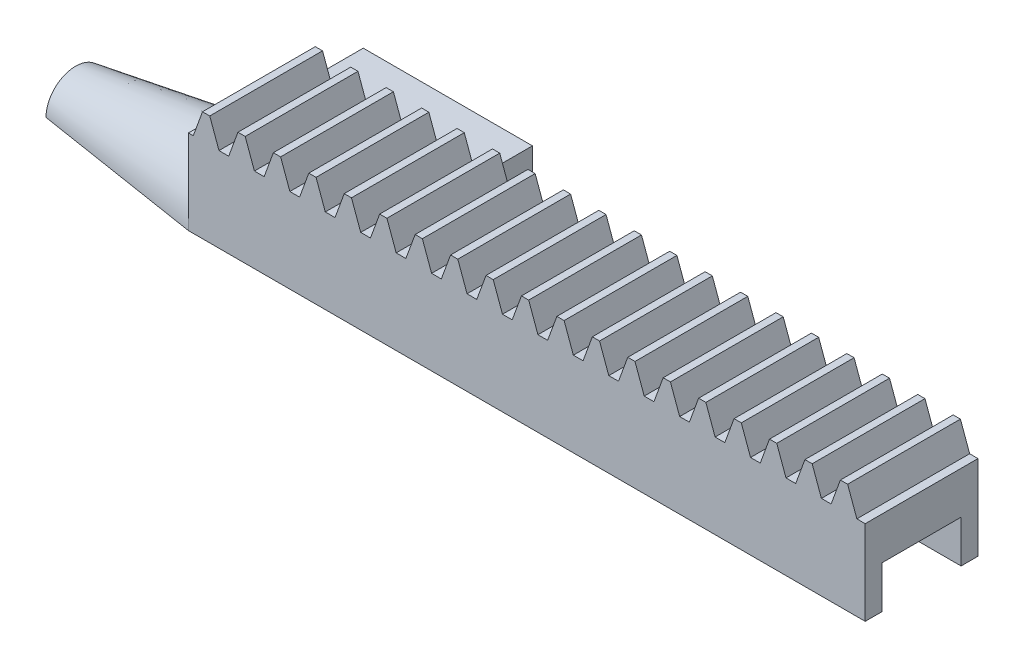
ISO-10303-21;
HEADER;
FILE_DESCRIPTION(('STEP AP214'),'2;1');
FILE_NAME('part.step','',(''),(''),'','','');
FILE_SCHEMA(('AUTOMOTIVE_DESIGN { 1 0 10303 214 1 1 1 1 }'));
ENDSEC;
DATA;
#1=APPLICATION_CONTEXT('core data for automotive mechanical design processes');
#2=APPLICATION_PROTOCOL_DEFINITION('international standard','automotive_design',2000,#1);
#3=PRODUCT_CONTEXT('',#1,'mechanical');
#4=PRODUCT('Part','Part','',(#3));
#5=PRODUCT_RELATED_PRODUCT_CATEGORY('part','',(#4));
#6=PRODUCT_DEFINITION_FORMATION('','',#4);
#7=PRODUCT_DEFINITION_CONTEXT('part definition',#1,'design');
#8=PRODUCT_DEFINITION('design','',#6,#7);
#9=PRODUCT_DEFINITION_SHAPE('','',#8);
#10=(LENGTH_UNIT() NAMED_UNIT(*) SI_UNIT(.MILLI.,.METRE.));
#11=(NAMED_UNIT(*) PLANE_ANGLE_UNIT() SI_UNIT($,.RADIAN.));
#12=(NAMED_UNIT(*) SI_UNIT($,.STERADIAN.) SOLID_ANGLE_UNIT());
#13=UNCERTAINTY_MEASURE_WITH_UNIT(LENGTH_MEASURE(1.E-05),#10,'distance_accuracy_value','');
#14=(GEOMETRIC_REPRESENTATION_CONTEXT(3) GLOBAL_UNCERTAINTY_ASSIGNED_CONTEXT((#13)) GLOBAL_UNIT_ASSIGNED_CONTEXT((#10,
#11,#12)) REPRESENTATION_CONTEXT('',''));
#15=CARTESIAN_POINT('',(0.,0.,0.));
#16=DIRECTION('',(0.,0.,1.));
#17=DIRECTION('',(1.,0.,0.));
#18=AXIS2_PLACEMENT_3D('',#15,#16,#17);
#19=CARTESIAN_POINT('',(0.,-7.5,0.));
#20=DIRECTION('',(0.,1.,0.));
#21=DIRECTION('',(0.,0.,1.));
#22=AXIS2_PLACEMENT_3D('',#19,#20,#21);
#23=PLANE('',#22);
#24=DIRECTION('',(0.,0.,-1.));
#25=VECTOR('',#24,1.);
#26=CARTESIAN_POINT('',(-30.,-7.5,-10.));
#27=LINE('',#26,#25);
#28=CARTESIAN_POINT('',(-30.,-7.5,-4.7515332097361));
#29=VERTEX_POINT('',#28);
#30=CARTESIAN_POINT('',(-30.,-7.5,-6.5));
#31=VERTEX_POINT('',#30);
#32=EDGE_CURVE('E11',#29,#31,#27,.T.);
#33=ORIENTED_EDGE('',*,*,#32,.T.);
#34=DIRECTION('',(0.996194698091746,0.,0.0871557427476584));
#35=VECTOR('',#34,1.);
#36=CARTESIAN_POINT('',(-70.0051830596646,-7.5,-10.));
#37=LINE('',#36,#35);
#38=CARTESIAN_POINT('',(0.,-7.5,-3.87534009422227));
#39=VERTEX_POINT('',#38);
#40=EDGE_CURVE('E50',#31,#39,#37,.T.);
#41=ORIENTED_EDGE('',*,*,#40,.T.);
#42=DIRECTION('',(0.,0.,1.));
#43=VECTOR('',#42,1.);
#44=CARTESIAN_POINT('',(0.,-7.5,6.90841105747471));
#45=LINE('',#44,#43);
#46=CARTESIAN_POINT('',(0.,-7.5,-3.));
#47=VERTEX_POINT('',#46);
#48=EDGE_CURVE('E629',#39,#47,#45,.T.);
#49=ORIENTED_EDGE('',*,*,#48,.T.);
#50=DIRECTION('',(1.,0.,0.));
#51=VECTOR('',#50,1.);
#52=CARTESIAN_POINT('',(0.,-7.5,-3.));
#53=LINE('',#52,#51);
#54=CARTESIAN_POINT('',(120.,-7.5,-3.));
#55=VERTEX_POINT('',#54);
#56=EDGE_CURVE('E699',#47,#55,#53,.T.);
#57=ORIENTED_EDGE('',*,*,#56,.T.);
#58=DIRECTION('',(0.,0.,1.));
#59=VECTOR('',#58,1.);
#60=CARTESIAN_POINT('',(120.,-7.5,-3.));
#61=LINE('',#60,#59);
#62=CARTESIAN_POINT('',(120.,-7.5,0.));
#63=VERTEX_POINT('',#62);
#64=EDGE_CURVE('E701',#55,#63,#61,.T.);
#65=ORIENTED_EDGE('',*,*,#64,.T.);
#66=DIRECTION('',(-1.,0.,0.));
#67=VECTOR('',#66,1.);
#68=CARTESIAN_POINT('',(120.,-7.5,0.));
#69=LINE('',#68,#67);
#70=CARTESIAN_POINT('',(0.,-7.5,0.));
#71=VERTEX_POINT('',#70);
#72=EDGE_CURVE('E704',#63,#71,#69,.T.);
#73=ORIENTED_EDGE('',*,*,#72,.T.);
#74=DIRECTION('',(0.987688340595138,0.,0.156434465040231));
#75=VECTOR('',#74,1.);
#76=CARTESIAN_POINT('',(-63.1375151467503,-7.5,-10.));
#77=LINE('',#76,#75);
#78=EDGE_CURVE('E57',#29,#71,#77,.T.);
#79=ORIENTED_EDGE('',*,*,#78,.F.);
#80=EDGE_LOOP('',(#33,#41,#49,#57,#65,#73,#79));
#81=FACE_BOUND('',#80,.T.);
#82=ADVANCED_FACE('F35',(#81),#23,.F.);
#83=CARTESIAN_POINT('',(0.,0.,-20.));
#84=DIRECTION('',(0.,-1.,0.));
#85=DIRECTION('',(0.,0.,-1.));
#86=AXIS2_PLACEMENT_3D('',#83,#84,#85);
#87=PLANE('',#86);
#88=DIRECTION('',(0.,0.,1.));
#89=VECTOR('',#88,1.);
#90=CARTESIAN_POINT('',(120.,0.,-20.));
#91=LINE('',#90,#89);
#92=CARTESIAN_POINT('',(120.,0.,-17.));
#93=VERTEX_POINT('',#92);
#94=CARTESIAN_POINT('',(120.,0.,-3.));
#95=VERTEX_POINT('',#94);
#96=EDGE_CURVE('E1216',#93,#95,#91,.T.);
#97=ORIENTED_EDGE('',*,*,#96,.T.);
#98=DIRECTION('',(1.,0.,0.));
#99=VECTOR('',#98,1.);
#100=CARTESIAN_POINT('',(0.,0.,-3.));
#101=LINE('',#100,#99);
#102=CARTESIAN_POINT('',(0.,0.,-3.));
#103=VERTEX_POINT('',#102);
#104=EDGE_CURVE('E688',#103,#95,#101,.T.);
#105=ORIENTED_EDGE('',*,*,#104,.F.);
#106=DIRECTION('',(0.,0.,1.));
#107=VECTOR('',#106,1.);
#108=CARTESIAN_POINT('',(0.,0.,-20.));
#109=LINE('',#108,#107);
#110=CARTESIAN_POINT('',(0.,0.,-3.38562172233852));
#111=VERTEX_POINT('',#110);
#112=EDGE_CURVE('E1205',#111,#103,#109,.T.);
#113=ORIENTED_EDGE('',*,*,#112,.F.);
#114=CARTESIAN_POINT('',(0.,0.,-16.6143782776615));
#115=VERTEX_POINT('',#114);
#116=EDGE_CURVE('E1222',#115,#111,#109,.T.);
#117=ORIENTED_EDGE('',*,*,#116,.F.);
#118=CARTESIAN_POINT('',(0.,0.,-17.));
#119=VERTEX_POINT('',#118);
#120=EDGE_CURVE('E1220',#119,#115,#109,.T.);
#121=ORIENTED_EDGE('',*,*,#120,.F.);
#122=DIRECTION('',(-1.,0.,0.));
#123=VECTOR('',#122,1.);
#124=CARTESIAN_POINT('',(0.,0.,-17.));
#125=LINE('',#124,#123);
#126=EDGE_CURVE('E712',#93,#119,#125,.T.);
#127=ORIENTED_EDGE('',*,*,#126,.F.);
#128=EDGE_LOOP('',(#97,#105,#113,#117,#121,#127));
#129=FACE_BOUND('',#128,.T.);
#130=ADVANCED_FACE('F1304',(#129),#87,.T.);
#131=CARTESIAN_POINT('',(0.,12.,-20.));
#132=DIRECTION('',(0.,1.,0.));
#133=DIRECTION('',(0.,0.,1.));
#134=AXIS2_PLACEMENT_3D('',#131,#132,#133);
#135=PLANE('',#134);
#136=DIRECTION('',(0.,0.,1.));
#137=VECTOR('',#136,1.);
#138=CARTESIAN_POINT('',(110.597598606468,12.,-20.));
#139=LINE('',#138,#137);
#140=CARTESIAN_POINT('',(110.597598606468,12.,-20.));
#141=VERTEX_POINT('',#140);
#142=CARTESIAN_POINT('',(110.597598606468,12.,0.));
#143=VERTEX_POINT('',#142);
#144=EDGE_CURVE('E767',#141,#143,#139,.T.);
#145=ORIENTED_EDGE('',*,*,#144,.F.);
#146=DIRECTION('',(-1.,0.,0.));
#147=VECTOR('',#146,1.);
#148=CARTESIAN_POINT('',(0.,12.,-20.));
#149=LINE('',#148,#147);
#150=CARTESIAN_POINT('',(109.313886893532,12.,-20.));
#151=VERTEX_POINT('',#150);
#152=EDGE_CURVE('E1206',#141,#151,#149,.T.);
#153=ORIENTED_EDGE('',*,*,#152,.T.);
#154=DIRECTION('',(0.,0.,-1.));
#155=VECTOR('',#154,1.);
#156=CARTESIAN_POINT('',(109.313886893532,12.,-20.));
#157=LINE('',#156,#155);
#158=CARTESIAN_POINT('',(109.313886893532,12.,0.));
#159=VERTEX_POINT('',#158);
#160=EDGE_CURVE('E787',#159,#151,#157,.T.);
#161=ORIENTED_EDGE('',*,*,#160,.F.);
#162=DIRECTION('',(-1.,0.,0.));
#163=VECTOR('',#162,1.);
#164=CARTESIAN_POINT('',(0.,12.,0.));
#165=LINE('',#164,#163);
#166=EDGE_CURVE('E1215',#143,#159,#165,.T.);
#167=ORIENTED_EDGE('',*,*,#166,.F.);
#168=EDGE_LOOP('',(#145,#153,#161,#167));
#169=FACE_BOUND('',#168,.T.);
#170=ADVANCED_FACE('F1360',(#169),#135,.T.);
#171=DIRECTION('',(0.,0.,1.));
#172=VECTOR('',#171,1.);
#173=CARTESIAN_POINT('',(104.314413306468,12.,-20.));
#174=LINE('',#173,#172);
#175=CARTESIAN_POINT('',(104.314413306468,12.,-20.));
#176=VERTEX_POINT('',#175);
#177=CARTESIAN_POINT('',(104.314413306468,12.,0.));
#178=VERTEX_POINT('',#177);
#179=EDGE_CURVE('E791',#176,#178,#174,.T.);
#180=ORIENTED_EDGE('',*,*,#179,.F.);
#181=CARTESIAN_POINT('',(103.030701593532,12.,-20.));
#182=VERTEX_POINT('',#181);
#183=EDGE_CURVE('E1363',#176,#182,#149,.T.);
#184=ORIENTED_EDGE('',*,*,#183,.T.);
#185=DIRECTION('',(0.,0.,-1.));
#186=VECTOR('',#185,1.);
#187=CARTESIAN_POINT('',(103.030701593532,12.,-20.));
#188=LINE('',#187,#186);
#189=CARTESIAN_POINT('',(103.030701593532,12.,0.));
#190=VERTEX_POINT('',#189);
#191=EDGE_CURVE('E811',#190,#182,#188,.T.);
#192=ORIENTED_EDGE('',*,*,#191,.F.);
#193=EDGE_CURVE('E1499',#178,#190,#165,.T.);
#194=ORIENTED_EDGE('',*,*,#193,.F.);
#195=EDGE_LOOP('',(#180,#184,#192,#194));
#196=FACE_BOUND('',#195,.T.);
#197=ADVANCED_FACE('F1513',(#196),#135,.T.);
#198=DIRECTION('',(0.,0.,1.));
#199=VECTOR('',#198,1.);
#200=CARTESIAN_POINT('',(98.0312280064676,12.,-20.));
#201=LINE('',#200,#199);
#202=CARTESIAN_POINT('',(98.0312280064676,12.,-20.));
#203=VERTEX_POINT('',#202);
#204=CARTESIAN_POINT('',(98.0312280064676,12.,0.));
#205=VERTEX_POINT('',#204);
#206=EDGE_CURVE('E815',#203,#205,#201,.T.);
#207=ORIENTED_EDGE('',*,*,#206,.F.);
#208=CARTESIAN_POINT('',(96.7475162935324,12.,-20.));
#209=VERTEX_POINT('',#208);
#210=EDGE_CURVE('E1364',#203,#209,#149,.T.);
#211=ORIENTED_EDGE('',*,*,#210,.T.);
#212=DIRECTION('',(0.,0.,-1.));
#213=VECTOR('',#212,1.);
#214=CARTESIAN_POINT('',(96.7475162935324,12.,-20.));
#215=LINE('',#214,#213);
#216=CARTESIAN_POINT('',(96.7475162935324,12.,0.));
#217=VERTEX_POINT('',#216);
#218=EDGE_CURVE('E835',#217,#209,#215,.T.);
#219=ORIENTED_EDGE('',*,*,#218,.F.);
#220=EDGE_CURVE('E1496',#205,#217,#165,.T.);
#221=ORIENTED_EDGE('',*,*,#220,.F.);
#222=EDGE_LOOP('',(#207,#211,#219,#221));
#223=FACE_BOUND('',#222,.T.);
#224=ADVANCED_FACE('F1523',(#223),#135,.T.);
#225=DIRECTION('',(0.,0.,1.));
#226=VECTOR('',#225,1.);
#227=CARTESIAN_POINT('',(91.7480427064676,12.,-20.));
#228=LINE('',#227,#226);
#229=CARTESIAN_POINT('',(91.7480427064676,12.,-20.));
#230=VERTEX_POINT('',#229);
#231=CARTESIAN_POINT('',(91.7480427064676,12.,0.));
#232=VERTEX_POINT('',#231);
#233=EDGE_CURVE('E839',#230,#232,#228,.T.);
#234=ORIENTED_EDGE('',*,*,#233,.F.);
#235=CARTESIAN_POINT('',(90.4643309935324,12.,-20.));
#236=VERTEX_POINT('',#235);
#237=EDGE_CURVE('E1369',#230,#236,#149,.T.);
#238=ORIENTED_EDGE('',*,*,#237,.T.);
#239=DIRECTION('',(0.,0.,-1.));
#240=VECTOR('',#239,1.);
#241=CARTESIAN_POINT('',(90.4643309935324,12.,-20.));
#242=LINE('',#241,#240);
#243=CARTESIAN_POINT('',(90.4643309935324,12.,0.));
#244=VERTEX_POINT('',#243);
#245=EDGE_CURVE('E859',#244,#236,#242,.T.);
#246=ORIENTED_EDGE('',*,*,#245,.F.);
#247=EDGE_CURVE('E1493',#232,#244,#165,.T.);
#248=ORIENTED_EDGE('',*,*,#247,.F.);
#249=EDGE_LOOP('',(#234,#238,#246,#248));
#250=FACE_BOUND('',#249,.T.);
#251=ADVANCED_FACE('F1533',(#250),#135,.T.);
#252=DIRECTION('',(0.,0.,1.));
#253=VECTOR('',#252,1.);
#254=CARTESIAN_POINT('',(85.4648574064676,12.,-20.));
#255=LINE('',#254,#253);
#256=CARTESIAN_POINT('',(85.4648574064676,12.,-20.));
#257=VERTEX_POINT('',#256);
#258=CARTESIAN_POINT('',(85.4648574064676,12.,0.));
#259=VERTEX_POINT('',#258);
#260=EDGE_CURVE('E863',#257,#259,#255,.T.);
#261=ORIENTED_EDGE('',*,*,#260,.F.);
#262=CARTESIAN_POINT('',(84.1811456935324,12.,-20.));
#263=VERTEX_POINT('',#262);
#264=EDGE_CURVE('E1374',#257,#263,#149,.T.);
#265=ORIENTED_EDGE('',*,*,#264,.T.);
#266=DIRECTION('',(0.,0.,-1.));
#267=VECTOR('',#266,1.);
#268=CARTESIAN_POINT('',(84.1811456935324,12.,-20.));
#269=LINE('',#268,#267);
#270=CARTESIAN_POINT('',(84.1811456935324,12.,0.));
#271=VERTEX_POINT('',#270);
#272=EDGE_CURVE('E883',#271,#263,#269,.T.);
#273=ORIENTED_EDGE('',*,*,#272,.F.);
#274=EDGE_CURVE('E1490',#259,#271,#165,.T.);
#275=ORIENTED_EDGE('',*,*,#274,.F.);
#276=EDGE_LOOP('',(#261,#265,#273,#275));
#277=FACE_BOUND('',#276,.T.);
#278=ADVANCED_FACE('F1543',(#277),#135,.T.);
#279=DIRECTION('',(0.,0.,1.));
#280=VECTOR('',#279,1.);
#281=CARTESIAN_POINT('',(79.1816721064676,12.,-20.));
#282=LINE('',#281,#280);
#283=CARTESIAN_POINT('',(79.1816721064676,12.,-20.));
#284=VERTEX_POINT('',#283);
#285=CARTESIAN_POINT('',(79.1816721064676,12.,0.));
#286=VERTEX_POINT('',#285);
#287=EDGE_CURVE('E887',#284,#286,#282,.T.);
#288=ORIENTED_EDGE('',*,*,#287,.F.);
#289=CARTESIAN_POINT('',(77.8979603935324,12.,-20.));
#290=VERTEX_POINT('',#289);
#291=EDGE_CURVE('E1379',#284,#290,#149,.T.);
#292=ORIENTED_EDGE('',*,*,#291,.T.);
#293=DIRECTION('',(0.,0.,-1.));
#294=VECTOR('',#293,1.);
#295=CARTESIAN_POINT('',(77.8979603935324,12.,-20.));
#296=LINE('',#295,#294);
#297=CARTESIAN_POINT('',(77.8979603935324,12.,0.));
#298=VERTEX_POINT('',#297);
#299=EDGE_CURVE('E907',#298,#290,#296,.T.);
#300=ORIENTED_EDGE('',*,*,#299,.F.);
#301=EDGE_CURVE('E1487',#286,#298,#165,.T.);
#302=ORIENTED_EDGE('',*,*,#301,.F.);
#303=EDGE_LOOP('',(#288,#292,#300,#302));
#304=FACE_BOUND('',#303,.T.);
#305=ADVANCED_FACE('F1553',(#304),#135,.T.);
#306=DIRECTION('',(0.,0.,1.));
#307=VECTOR('',#306,1.);
#308=CARTESIAN_POINT('',(72.8984868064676,12.,-20.));
#309=LINE('',#308,#307);
#310=CARTESIAN_POINT('',(72.8984868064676,12.,-20.));
#311=VERTEX_POINT('',#310);
#312=CARTESIAN_POINT('',(72.8984868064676,12.,0.));
#313=VERTEX_POINT('',#312);
#314=EDGE_CURVE('E911',#311,#313,#309,.T.);
#315=ORIENTED_EDGE('',*,*,#314,.F.);
#316=CARTESIAN_POINT('',(71.6147750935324,12.,-20.));
#317=VERTEX_POINT('',#316);
#318=EDGE_CURVE('E1384',#311,#317,#149,.T.);
#319=ORIENTED_EDGE('',*,*,#318,.T.);
#320=DIRECTION('',(0.,0.,-1.));
#321=VECTOR('',#320,1.);
#322=CARTESIAN_POINT('',(71.6147750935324,12.,-20.));
#323=LINE('',#322,#321);
#324=CARTESIAN_POINT('',(71.6147750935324,12.,0.));
#325=VERTEX_POINT('',#324);
#326=EDGE_CURVE('E931',#325,#317,#323,.T.);
#327=ORIENTED_EDGE('',*,*,#326,.F.);
#328=EDGE_CURVE('E1484',#313,#325,#165,.T.);
#329=ORIENTED_EDGE('',*,*,#328,.F.);
#330=EDGE_LOOP('',(#315,#319,#327,#329));
#331=FACE_BOUND('',#330,.T.);
#332=ADVANCED_FACE('F1563',(#331),#135,.T.);
#333=DIRECTION('',(0.,0.,1.));
#334=VECTOR('',#333,1.);
#335=CARTESIAN_POINT('',(66.6153015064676,12.,-20.));
#336=LINE('',#335,#334);
#337=CARTESIAN_POINT('',(66.6153015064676,12.,-20.));
#338=VERTEX_POINT('',#337);
#339=CARTESIAN_POINT('',(66.6153015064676,12.,0.));
#340=VERTEX_POINT('',#339);
#341=EDGE_CURVE('E935',#338,#340,#336,.T.);
#342=ORIENTED_EDGE('',*,*,#341,.F.);
#343=CARTESIAN_POINT('',(65.3315897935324,12.,-20.));
#344=VERTEX_POINT('',#343);
#345=EDGE_CURVE('E1389',#338,#344,#149,.T.);
#346=ORIENTED_EDGE('',*,*,#345,.T.);
#347=DIRECTION('',(0.,0.,-1.));
#348=VECTOR('',#347,1.);
#349=CARTESIAN_POINT('',(65.3315897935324,12.,-20.));
#350=LINE('',#349,#348);
#351=CARTESIAN_POINT('',(65.3315897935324,12.,0.));
#352=VERTEX_POINT('',#351);
#353=EDGE_CURVE('E955',#352,#344,#350,.T.);
#354=ORIENTED_EDGE('',*,*,#353,.F.);
#355=EDGE_CURVE('E1481',#340,#352,#165,.T.);
#356=ORIENTED_EDGE('',*,*,#355,.F.);
#357=EDGE_LOOP('',(#342,#346,#354,#356));
#358=FACE_BOUND('',#357,.T.);
#359=ADVANCED_FACE('F1573',(#358),#135,.T.);
#360=DIRECTION('',(0.,0.,1.));
#361=VECTOR('',#360,1.);
#362=CARTESIAN_POINT('',(60.3321162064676,12.,-20.));
#363=LINE('',#362,#361);
#364=CARTESIAN_POINT('',(60.3321162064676,12.,-20.));
#365=VERTEX_POINT('',#364);
#366=CARTESIAN_POINT('',(60.3321162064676,12.,0.));
#367=VERTEX_POINT('',#366);
#368=EDGE_CURVE('E959',#365,#367,#363,.T.);
#369=ORIENTED_EDGE('',*,*,#368,.F.);
#370=CARTESIAN_POINT('',(59.0484044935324,12.,-20.));
#371=VERTEX_POINT('',#370);
#372=EDGE_CURVE('E1394',#365,#371,#149,.T.);
#373=ORIENTED_EDGE('',*,*,#372,.T.);
#374=DIRECTION('',(0.,0.,-1.));
#375=VECTOR('',#374,1.);
#376=CARTESIAN_POINT('',(59.0484044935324,12.,-20.));
#377=LINE('',#376,#375);
#378=CARTESIAN_POINT('',(59.0484044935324,12.,0.));
#379=VERTEX_POINT('',#378);
#380=EDGE_CURVE('E979',#379,#371,#377,.T.);
#381=ORIENTED_EDGE('',*,*,#380,.F.);
#382=EDGE_CURVE('E1478',#367,#379,#165,.T.);
#383=ORIENTED_EDGE('',*,*,#382,.F.);
#384=EDGE_LOOP('',(#369,#373,#381,#383));
#385=FACE_BOUND('',#384,.T.);
#386=ADVANCED_FACE('F1583',(#385),#135,.T.);
#387=DIRECTION('',(0.,0.,1.));
#388=VECTOR('',#387,1.);
#389=CARTESIAN_POINT('',(54.0489309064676,12.,-20.));
#390=LINE('',#389,#388);
#391=CARTESIAN_POINT('',(54.0489309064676,12.,-20.));
#392=VERTEX_POINT('',#391);
#393=CARTESIAN_POINT('',(54.0489309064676,12.,0.));
#394=VERTEX_POINT('',#393);
#395=EDGE_CURVE('E983',#392,#394,#390,.T.);
#396=ORIENTED_EDGE('',*,*,#395,.F.);
#397=CARTESIAN_POINT('',(52.7652191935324,12.,-20.));
#398=VERTEX_POINT('',#397);
#399=EDGE_CURVE('E1399',#392,#398,#149,.T.);
#400=ORIENTED_EDGE('',*,*,#399,.T.);
#401=DIRECTION('',(0.,0.,-1.));
#402=VECTOR('',#401,1.);
#403=CARTESIAN_POINT('',(52.7652191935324,12.,-20.));
#404=LINE('',#403,#402);
#405=CARTESIAN_POINT('',(52.7652191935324,12.,0.));
#406=VERTEX_POINT('',#405);
#407=EDGE_CURVE('E1003',#406,#398,#404,.T.);
#408=ORIENTED_EDGE('',*,*,#407,.F.);
#409=EDGE_CURVE('E1475',#394,#406,#165,.T.);
#410=ORIENTED_EDGE('',*,*,#409,.F.);
#411=EDGE_LOOP('',(#396,#400,#408,#410));
#412=FACE_BOUND('',#411,.T.);
#413=ADVANCED_FACE('F1593',(#412),#135,.T.);
#414=DIRECTION('',(0.,0.,1.));
#415=VECTOR('',#414,1.);
#416=CARTESIAN_POINT('',(47.7657456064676,12.,-20.));
#417=LINE('',#416,#415);
#418=CARTESIAN_POINT('',(47.7657456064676,12.,-20.));
#419=VERTEX_POINT('',#418);
#420=CARTESIAN_POINT('',(47.7657456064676,12.,0.));
#421=VERTEX_POINT('',#420);
#422=EDGE_CURVE('E1007',#419,#421,#417,.T.);
#423=ORIENTED_EDGE('',*,*,#422,.F.);
#424=CARTESIAN_POINT('',(46.4820338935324,12.,-20.));
#425=VERTEX_POINT('',#424);
#426=EDGE_CURVE('E1404',#419,#425,#149,.T.);
#427=ORIENTED_EDGE('',*,*,#426,.T.);
#428=DIRECTION('',(0.,0.,-1.));
#429=VECTOR('',#428,1.);
#430=CARTESIAN_POINT('',(46.4820338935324,12.,-20.));
#431=LINE('',#430,#429);
#432=CARTESIAN_POINT('',(46.4820338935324,12.,0.));
#433=VERTEX_POINT('',#432);
#434=EDGE_CURVE('E1027',#433,#425,#431,.T.);
#435=ORIENTED_EDGE('',*,*,#434,.F.);
#436=EDGE_CURVE('E1472',#421,#433,#165,.T.);
#437=ORIENTED_EDGE('',*,*,#436,.F.);
#438=EDGE_LOOP('',(#423,#427,#435,#437));
#439=FACE_BOUND('',#438,.T.);
#440=ADVANCED_FACE('F1603',(#439),#135,.T.);
#441=DIRECTION('',(0.,0.,1.));
#442=VECTOR('',#441,1.);
#443=CARTESIAN_POINT('',(41.4825603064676,12.,-20.));
#444=LINE('',#443,#442);
#445=CARTESIAN_POINT('',(41.4825603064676,12.,-20.));
#446=VERTEX_POINT('',#445);
#447=CARTESIAN_POINT('',(41.4825603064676,12.,0.));
#448=VERTEX_POINT('',#447);
#449=EDGE_CURVE('E1031',#446,#448,#444,.T.);
#450=ORIENTED_EDGE('',*,*,#449,.F.);
#451=CARTESIAN_POINT('',(40.1988485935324,12.,-20.));
#452=VERTEX_POINT('',#451);
#453=EDGE_CURVE('E1409',#446,#452,#149,.T.);
#454=ORIENTED_EDGE('',*,*,#453,.T.);
#455=DIRECTION('',(0.,0.,-1.));
#456=VECTOR('',#455,1.);
#457=CARTESIAN_POINT('',(40.1988485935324,12.,-20.));
#458=LINE('',#457,#456);
#459=CARTESIAN_POINT('',(40.1988485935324,12.,0.));
#460=VERTEX_POINT('',#459);
#461=EDGE_CURVE('E1051',#460,#452,#458,.T.);
#462=ORIENTED_EDGE('',*,*,#461,.F.);
#463=EDGE_CURVE('E1469',#448,#460,#165,.T.);
#464=ORIENTED_EDGE('',*,*,#463,.F.);
#465=EDGE_LOOP('',(#450,#454,#462,#464));
#466=FACE_BOUND('',#465,.T.);
#467=ADVANCED_FACE('F1613',(#466),#135,.T.);
#468=DIRECTION('',(0.,0.,1.));
#469=VECTOR('',#468,1.);
#470=CARTESIAN_POINT('',(35.1993750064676,12.,-20.));
#471=LINE('',#470,#469);
#472=CARTESIAN_POINT('',(35.1993750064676,12.,-20.));
#473=VERTEX_POINT('',#472);
#474=CARTESIAN_POINT('',(35.1993750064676,12.,0.));
#475=VERTEX_POINT('',#474);
#476=EDGE_CURVE('E1055',#473,#475,#471,.T.);
#477=ORIENTED_EDGE('',*,*,#476,.F.);
#478=CARTESIAN_POINT('',(33.9156632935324,12.,-20.));
#479=VERTEX_POINT('',#478);
#480=EDGE_CURVE('E1414',#473,#479,#149,.T.);
#481=ORIENTED_EDGE('',*,*,#480,.T.);
#482=DIRECTION('',(0.,0.,-1.));
#483=VECTOR('',#482,1.);
#484=CARTESIAN_POINT('',(33.9156632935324,12.,-20.));
#485=LINE('',#484,#483);
#486=CARTESIAN_POINT('',(33.9156632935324,12.,0.));
#487=VERTEX_POINT('',#486);
#488=EDGE_CURVE('E1075',#487,#479,#485,.T.);
#489=ORIENTED_EDGE('',*,*,#488,.F.);
#490=EDGE_CURVE('E1466',#475,#487,#165,.T.);
#491=ORIENTED_EDGE('',*,*,#490,.F.);
#492=EDGE_LOOP('',(#477,#481,#489,#491));
#493=FACE_BOUND('',#492,.T.);
#494=ADVANCED_FACE('F1623',(#493),#135,.T.);
#495=DIRECTION('',(0.,0.,1.));
#496=VECTOR('',#495,1.);
#497=CARTESIAN_POINT('',(28.9161897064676,12.,-20.));
#498=LINE('',#497,#496);
#499=CARTESIAN_POINT('',(28.9161897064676,12.,-20.));
#500=VERTEX_POINT('',#499);
#501=CARTESIAN_POINT('',(28.9161897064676,12.,0.));
#502=VERTEX_POINT('',#501);
#503=EDGE_CURVE('E1079',#500,#502,#498,.T.);
#504=ORIENTED_EDGE('',*,*,#503,.F.);
#505=CARTESIAN_POINT('',(27.6324779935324,12.,-20.));
#506=VERTEX_POINT('',#505);
#507=EDGE_CURVE('E1419',#500,#506,#149,.T.);
#508=ORIENTED_EDGE('',*,*,#507,.T.);
#509=DIRECTION('',(0.,0.,-1.));
#510=VECTOR('',#509,1.);
#511=CARTESIAN_POINT('',(27.6324779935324,12.,-20.));
#512=LINE('',#511,#510);
#513=CARTESIAN_POINT('',(27.6324779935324,12.,0.));
#514=VERTEX_POINT('',#513);
#515=EDGE_CURVE('E1099',#514,#506,#512,.T.);
#516=ORIENTED_EDGE('',*,*,#515,.F.);
#517=EDGE_CURVE('E1463',#502,#514,#165,.T.);
#518=ORIENTED_EDGE('',*,*,#517,.F.);
#519=EDGE_LOOP('',(#504,#508,#516,#518));
#520=FACE_BOUND('',#519,.T.);
#521=ADVANCED_FACE('F1633',(#520),#135,.T.);
#522=DIRECTION('',(0.,0.,1.));
#523=VECTOR('',#522,1.);
#524=CARTESIAN_POINT('',(22.6330044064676,12.,-20.));
#525=LINE('',#524,#523);
#526=CARTESIAN_POINT('',(22.6330044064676,12.,-20.));
#527=VERTEX_POINT('',#526);
#528=CARTESIAN_POINT('',(22.6330044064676,12.,0.));
#529=VERTEX_POINT('',#528);
#530=EDGE_CURVE('E1103',#527,#529,#525,.T.);
#531=ORIENTED_EDGE('',*,*,#530,.F.);
#532=CARTESIAN_POINT('',(21.3492926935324,12.,-20.));
#533=VERTEX_POINT('',#532);
#534=EDGE_CURVE('E1424',#527,#533,#149,.T.);
#535=ORIENTED_EDGE('',*,*,#534,.T.);
#536=DIRECTION('',(0.,0.,-1.));
#537=VECTOR('',#536,1.);
#538=CARTESIAN_POINT('',(21.3492926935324,12.,-20.));
#539=LINE('',#538,#537);
#540=CARTESIAN_POINT('',(21.3492926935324,12.,0.));
#541=VERTEX_POINT('',#540);
#542=EDGE_CURVE('E1123',#541,#533,#539,.T.);
#543=ORIENTED_EDGE('',*,*,#542,.F.);
#544=EDGE_CURVE('E1460',#529,#541,#165,.T.);
#545=ORIENTED_EDGE('',*,*,#544,.F.);
#546=EDGE_LOOP('',(#531,#535,#543,#545));
#547=FACE_BOUND('',#546,.T.);
#548=ADVANCED_FACE('F1643',(#547),#135,.T.);
#549=DIRECTION('',(0.,0.,1.));
#550=VECTOR('',#549,1.);
#551=CARTESIAN_POINT('',(16.3498191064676,12.,-20.));
#552=LINE('',#551,#550);
#553=CARTESIAN_POINT('',(16.3498191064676,12.,-20.));
#554=VERTEX_POINT('',#553);
#555=CARTESIAN_POINT('',(16.3498191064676,12.,0.));
#556=VERTEX_POINT('',#555);
#557=EDGE_CURVE('E1127',#554,#556,#552,.T.);
#558=ORIENTED_EDGE('',*,*,#557,.F.);
#559=CARTESIAN_POINT('',(15.0661073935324,12.,-20.));
#560=VERTEX_POINT('',#559);
#561=EDGE_CURVE('E1429',#554,#560,#149,.T.);
#562=ORIENTED_EDGE('',*,*,#561,.T.);
#563=DIRECTION('',(0.,0.,-1.));
#564=VECTOR('',#563,1.);
#565=CARTESIAN_POINT('',(15.0661073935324,12.,-20.));
#566=LINE('',#565,#564);
#567=CARTESIAN_POINT('',(15.0661073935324,12.,0.));
#568=VERTEX_POINT('',#567);
#569=EDGE_CURVE('E1147',#568,#560,#566,.T.);
#570=ORIENTED_EDGE('',*,*,#569,.F.);
#571=EDGE_CURVE('E1457',#556,#568,#165,.T.);
#572=ORIENTED_EDGE('',*,*,#571,.F.);
#573=EDGE_LOOP('',(#558,#562,#570,#572));
#574=FACE_BOUND('',#573,.T.);
#575=ADVANCED_FACE('F1653',(#574),#135,.T.);
#576=DIRECTION('',(0.,0.,1.));
#577=VECTOR('',#576,1.);
#578=CARTESIAN_POINT('',(10.0666338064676,12.,-20.));
#579=LINE('',#578,#577);
#580=CARTESIAN_POINT('',(10.0666338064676,12.,-20.));
#581=VERTEX_POINT('',#580);
#582=CARTESIAN_POINT('',(10.0666338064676,12.,0.));
#583=VERTEX_POINT('',#582);
#584=EDGE_CURVE('E1151',#581,#583,#579,.T.);
#585=ORIENTED_EDGE('',*,*,#584,.F.);
#586=CARTESIAN_POINT('',(8.78292209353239,12.,-20.));
#587=VERTEX_POINT('',#586);
#588=EDGE_CURVE('E1434',#581,#587,#149,.T.);
#589=ORIENTED_EDGE('',*,*,#588,.T.);
#590=DIRECTION('',(0.,0.,-1.));
#591=VECTOR('',#590,1.);
#592=CARTESIAN_POINT('',(8.78292209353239,12.,-20.));
#593=LINE('',#592,#591);
#594=CARTESIAN_POINT('',(8.78292209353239,12.,0.));
#595=VERTEX_POINT('',#594);
#596=EDGE_CURVE('E1171',#595,#587,#593,.T.);
#597=ORIENTED_EDGE('',*,*,#596,.F.);
#598=EDGE_CURVE('E1456',#583,#595,#165,.T.);
#599=ORIENTED_EDGE('',*,*,#598,.F.);
#600=EDGE_LOOP('',(#585,#589,#597,#599));
#601=FACE_BOUND('',#600,.T.);
#602=ADVANCED_FACE('F1663',(#601),#135,.T.);
#603=DIRECTION('',(0.,0.,1.));
#604=VECTOR('',#603,1.);
#605=CARTESIAN_POINT('',(3.78344850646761,12.,-20.));
#606=LINE('',#605,#604);
#607=CARTESIAN_POINT('',(3.78344850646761,12.,-20.));
#608=VERTEX_POINT('',#607);
#609=CARTESIAN_POINT('',(3.78344850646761,12.,0.));
#610=VERTEX_POINT('',#609);
#611=EDGE_CURVE('E1175',#608,#610,#606,.T.);
#612=ORIENTED_EDGE('',*,*,#611,.F.);
#613=CARTESIAN_POINT('',(2.49973679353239,12.,-20.));
#614=VERTEX_POINT('',#613);
#615=EDGE_CURVE('E1202',#608,#614,#149,.T.);
#616=ORIENTED_EDGE('',*,*,#615,.T.);
#617=DIRECTION('',(0.,0.,-1.));
#618=VECTOR('',#617,1.);
#619=CARTESIAN_POINT('',(2.49973679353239,12.,-20.));
#620=LINE('',#619,#618);
#621=CARTESIAN_POINT('',(2.49973679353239,12.,0.));
#622=VERTEX_POINT('',#621);
#623=EDGE_CURVE('E1191',#622,#614,#620,.T.);
#624=ORIENTED_EDGE('',*,*,#623,.F.);
#625=EDGE_CURVE('E1212',#610,#622,#165,.T.);
#626=ORIENTED_EDGE('',*,*,#625,.F.);
#627=EDGE_LOOP('',(#612,#616,#624,#626));
#628=FACE_BOUND('',#627,.T.);
#629=ADVANCED_FACE('F1447',(#628),#135,.T.);
#630=CARTESIAN_POINT('',(0.,0.,-20.));
#631=DIRECTION('',(-1.,0.,0.));
#632=DIRECTION('',(0.,0.,1.));
#633=AXIS2_PLACEMENT_3D('',#630,#631,#632);
#634=PLANE('',#633);
#635=CARTESIAN_POINT('',(0.,-7.5,-10.));
#636=DIRECTION('',(-1.,0.,0.));
#637=DIRECTION('',(0.,0.,1.));
#638=AXIS2_PLACEMENT_3D('',#635,#636,#637);
#639=CIRCLE('',#638,10.);
#640=CARTESIAN_POINT('',(0.,-0.35857157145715,-3.));
#641=VERTEX_POINT('',#640);
#642=EDGE_CURVE('E645',#71,#641,#639,.T.);
#643=ORIENTED_EDGE('',*,*,#642,.F.);
#644=DIRECTION('',(0.,-1.,0.));
#645=VECTOR('',#644,1.);
#646=CARTESIAN_POINT('',(0.,0.,0.));
#647=LINE('',#646,#645);
#648=CARTESIAN_POINT('',(0.,7.5,0.));
#649=VERTEX_POINT('',#648);
#650=EDGE_CURVE('E1194',#649,#71,#647,.T.);
#651=ORIENTED_EDGE('',*,*,#650,.F.);
#652=DIRECTION('',(0.,0.,1.));
#653=VECTOR('',#652,1.);
#654=CARTESIAN_POINT('',(0.,7.5,-20.));
#655=LINE('',#654,#653);
#656=CARTESIAN_POINT('',(0.,7.5,-20.));
#657=VERTEX_POINT('',#656);
#658=EDGE_CURVE('E1189',#657,#649,#655,.T.);
#659=ORIENTED_EDGE('',*,*,#658,.F.);
#660=DIRECTION('',(0.,-1.,0.));
#661=VECTOR('',#660,1.);
#662=CARTESIAN_POINT('',(0.,0.,-20.));
#663=LINE('',#662,#661);
#664=CARTESIAN_POINT('',(0.,5.01923788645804,-19.9999999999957));
#665=VERTEX_POINT('',#664);
#666=EDGE_CURVE('E1195',#657,#665,#663,.T.);
#667=ORIENTED_EDGE('',*,*,#666,.T.);
#668=DIRECTION('',(0.,0.,-1.));
#669=VECTOR('',#668,1.);
#670=CARTESIAN_POINT('',(0.,5.01923788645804,-19.9999999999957));
#671=LINE('',#670,#669);
#672=CARTESIAN_POINT('',(0.,5.01923788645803,-30.9999999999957));
#673=VERTEX_POINT('',#672);
#674=EDGE_CURVE('E653',#665,#673,#671,.T.);
#675=ORIENTED_EDGE('',*,*,#674,.T.);
#676=DIRECTION('',(0.,-1.,0.));
#677=VECTOR('',#676,1.);
#678=CARTESIAN_POINT('',(0.,5.01923788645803,-30.9999999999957));
#679=LINE('',#678,#677);
#680=CARTESIAN_POINT('',(0.,-3.48076211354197,-30.9999999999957));
#681=VERTEX_POINT('',#680);
#682=EDGE_CURVE('E675',#673,#681,#679,.T.);
#683=ORIENTED_EDGE('',*,*,#682,.T.);
#684=DIRECTION('',(0.,0.,1.));
#685=VECTOR('',#684,1.);
#686=CARTESIAN_POINT('',(0.,-3.48076211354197,-30.9999999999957));
#687=LINE('',#686,#685);
#688=CARTESIAN_POINT('',(0.,-3.48076211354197,-23.9999999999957));
#689=VERTEX_POINT('',#688);
#690=EDGE_CURVE('E678',#681,#689,#687,.T.);
#691=ORIENTED_EDGE('',*,*,#690,.T.);
#692=DIRECTION('',(0.,1.,0.));
#693=VECTOR('',#692,1.);
#694=CARTESIAN_POINT('',(0.,-3.48076211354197,-23.9999999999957));
#695=LINE('',#694,#693);
#696=CARTESIAN_POINT('',(0.,0.0192378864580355,-23.9999999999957));
#697=VERTEX_POINT('',#696);
#698=EDGE_CURVE('E681',#689,#697,#695,.T.);
#699=ORIENTED_EDGE('',*,*,#698,.T.);
#700=DIRECTION('',(0.,0.,1.));
#701=VECTOR('',#700,1.);
#702=CARTESIAN_POINT('',(0.,0.0192378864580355,-23.9999999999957));
#703=LINE('',#702,#701);
#704=CARTESIAN_POINT('',(0.,0.0192378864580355,-20.));
#705=VERTEX_POINT('',#704);
#706=EDGE_CURVE('E658',#697,#705,#703,.T.);
#707=ORIENTED_EDGE('',*,*,#706,.T.);
#708=CARTESIAN_POINT('',(0.,-7.5,-20.));
#709=VERTEX_POINT('',#708);
#710=EDGE_CURVE('E1199',#705,#709,#663,.T.);
#711=ORIENTED_EDGE('',*,*,#710,.T.);
#712=CARTESIAN_POINT('',(0.,-0.35857157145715,-17.));
#713=VERTEX_POINT('',#712);
#714=EDGE_CURVE('E650',#713,#709,#639,.T.);
#715=ORIENTED_EDGE('',*,*,#714,.F.);
#716=DIRECTION('',(0.,1.,0.));
#717=VECTOR('',#716,1.);
#718=CARTESIAN_POINT('',(0.,-7.5,-17.));
#719=LINE('',#718,#717);
#720=EDGE_CURVE('E722',#713,#119,#719,.T.);
#721=ORIENTED_EDGE('',*,*,#720,.T.);
#722=ORIENTED_EDGE('',*,*,#120,.T.);
#723=EDGE_CURVE('E1285',#111,#115,#639,.T.);
#724=ORIENTED_EDGE('',*,*,#723,.F.);
#725=ORIENTED_EDGE('',*,*,#112,.T.);
#726=DIRECTION('',(0.,1.,0.));
#727=VECTOR('',#726,1.);
#728=CARTESIAN_POINT('',(0.,-7.5,-3.));
#729=LINE('',#728,#727);
#730=EDGE_CURVE('E710',#641,#103,#729,.T.);
#731=ORIENTED_EDGE('',*,*,#730,.F.);
#732=EDGE_LOOP('',(#643,#651,#659,#667,#675,#683,#691,#699,#707,#711,#715,#721,#722,#724,#725,#731));
#733=FACE_BOUND('',#732,.T.);
#734=ADVANCED_FACE('F37',(#733),#634,.T.);
#735=DIRECTION('',(0.,0.,1.));
#736=VECTOR('',#735,1.);
#737=CARTESIAN_POINT('',(116.880783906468,12.,-20.));
#738=LINE('',#737,#736);
#739=CARTESIAN_POINT('',(116.880783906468,12.,-20.));
#740=VERTEX_POINT('',#739);
#741=CARTESIAN_POINT('',(116.880783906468,12.,0.));
#742=VERTEX_POINT('',#741);
#743=EDGE_CURVE('E743',#740,#742,#738,.T.);
#744=ORIENTED_EDGE('',*,*,#743,.F.);
#745=CARTESIAN_POINT('',(115.597072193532,12.,-20.));
#746=VERTEX_POINT('',#745);
#747=EDGE_CURVE('E1203',#740,#746,#149,.T.);
#748=ORIENTED_EDGE('',*,*,#747,.T.);
#749=DIRECTION('',(0.,0.,-1.));
#750=VECTOR('',#749,1.);
#751=CARTESIAN_POINT('',(115.597072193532,12.,-20.));
#752=LINE('',#751,#750);
#753=CARTESIAN_POINT('',(115.597072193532,12.,0.));
#754=VERTEX_POINT('',#753);
#755=EDGE_CURVE('E763',#754,#746,#752,.T.);
#756=ORIENTED_EDGE('',*,*,#755,.F.);
#757=EDGE_CURVE('E1213',#742,#754,#165,.T.);
#758=ORIENTED_EDGE('',*,*,#757,.F.);
#759=EDGE_LOOP('',(#744,#748,#756,#758));
#760=FACE_BOUND('',#759,.T.);
#761=ADVANCED_FACE('F1343',(#760),#135,.T.);
#762=CARTESIAN_POINT('',(120.,0.,-20.));
#763=DIRECTION('',(1.,0.,0.));
#764=DIRECTION('',(0.,0.,-1.));
#765=AXIS2_PLACEMENT_3D('',#762,#763,#764);
#766=PLANE('',#765);
#767=DIRECTION('',(0.,0.,-1.));
#768=VECTOR('',#767,1.);
#769=CARTESIAN_POINT('',(120.,7.5,-20.));
#770=LINE('',#769,#768);
#771=CARTESIAN_POINT('',(120.,7.5,0.));
#772=VERTEX_POINT('',#771);
#773=CARTESIAN_POINT('',(120.,7.5,-20.));
#774=VERTEX_POINT('',#773);
#775=EDGE_CURVE('E741',#772,#774,#770,.T.);
#776=ORIENTED_EDGE('',*,*,#775,.F.);
#777=DIRECTION('',(0.,1.,0.));
#778=VECTOR('',#777,1.);
#779=CARTESIAN_POINT('',(120.,0.,0.));
#780=LINE('',#779,#778);
#781=EDGE_CURVE('E1209',#63,#772,#780,.T.);
#782=ORIENTED_EDGE('',*,*,#781,.F.);
#783=ORIENTED_EDGE('',*,*,#64,.F.);
#784=DIRECTION('',(0.,1.,0.));
#785=VECTOR('',#784,1.);
#786=CARTESIAN_POINT('',(120.,-7.5,-3.));
#787=LINE('',#786,#785);
#788=EDGE_CURVE('E706',#55,#95,#787,.T.);
#789=ORIENTED_EDGE('',*,*,#788,.T.);
#790=ORIENTED_EDGE('',*,*,#96,.F.);
#791=DIRECTION('',(0.,1.,0.));
#792=VECTOR('',#791,1.);
#793=CARTESIAN_POINT('',(120.,-7.5,-17.));
#794=LINE('',#793,#792);
#795=CARTESIAN_POINT('',(120.,-7.5,-17.));
#796=VERTEX_POINT('',#795);
#797=EDGE_CURVE('E728',#796,#93,#794,.T.);
#798=ORIENTED_EDGE('',*,*,#797,.F.);
#799=DIRECTION('',(0.,0.,1.));
#800=VECTOR('',#799,1.);
#801=CARTESIAN_POINT('',(120.,-7.5,-17.));
#802=LINE('',#801,#800);
#803=CARTESIAN_POINT('',(120.,-7.5,-20.));
#804=VERTEX_POINT('',#803);
#805=EDGE_CURVE('E713',#804,#796,#802,.T.);
#806=ORIENTED_EDGE('',*,*,#805,.F.);
#807=DIRECTION('',(0.,1.,0.));
#808=VECTOR('',#807,1.);
#809=CARTESIAN_POINT('',(120.,0.,-20.));
#810=LINE('',#809,#808);
#811=EDGE_CURVE('E1198',#804,#774,#810,.T.);
#812=ORIENTED_EDGE('',*,*,#811,.T.);
#813=EDGE_LOOP('',(#776,#782,#783,#789,#790,#798,#806,#812));
#814=FACE_BOUND('',#813,.T.);
#815=ADVANCED_FACE('F1316',(#814),#766,.T.);
#816=CARTESIAN_POINT('',(0.,12.,-20.));
#817=DIRECTION('',(0.,0.,-1.));
#818=DIRECTION('',(-1.,0.,0.));
#819=AXIS2_PLACEMENT_3D('',#816,#817,#818);
#820=PLANE('',#819);
#821=DIRECTION('',(-1.,0.,0.));
#822=VECTOR('',#821,1.);
#823=CARTESIAN_POINT('',(30.,5.01923788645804,-19.9999999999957));
#824=LINE('',#823,#822);
#825=CARTESIAN_POINT('',(30.,5.01923788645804,-19.9999999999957));
#826=VERTEX_POINT('',#825);
#827=EDGE_CURVE('E685',#826,#665,#824,.T.);
#828=ORIENTED_EDGE('',*,*,#827,.T.);
#829=ORIENTED_EDGE('',*,*,#666,.F.);
#830=DIRECTION('',(1.,0.,0.));
#831=VECTOR('',#830,1.);
#832=CARTESIAN_POINT('',(0.86187073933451,7.5,-20.));
#833=LINE('',#832,#831);
#834=CARTESIAN_POINT('',(0.86187073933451,7.5,-20.));
#835=VERTEX_POINT('',#834);
#836=EDGE_CURVE('E1178',#657,#835,#833,.T.);
#837=ORIENTED_EDGE('',*,*,#836,.T.);
#838=DIRECTION('',(0.342020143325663,0.939692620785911,0.));
#839=VECTOR('',#838,1.);
#840=CARTESIAN_POINT('',(2.50898163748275,12.0254,-20.));
#841=LINE('',#840,#839);
#842=EDGE_CURVE('E1181',#835,#614,#841,.T.);
#843=ORIENTED_EDGE('',*,*,#842,.T.);
#844=ORIENTED_EDGE('',*,*,#615,.F.);
#845=DIRECTION('',(0.342020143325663,-0.939692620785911,0.));
#846=VECTOR('',#845,1.);
#847=CARTESIAN_POINT('',(3.77420366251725,12.0254,-20.));
#848=LINE('',#847,#846);
#849=CARTESIAN_POINT('',(5.42131456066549,7.5,-20.));
#850=VERTEX_POINT('',#849);
#851=EDGE_CURVE('E1154',#608,#850,#848,.T.);
#852=ORIENTED_EDGE('',*,*,#851,.T.);
#853=DIRECTION('',(1.,0.,0.));
#854=VECTOR('',#853,1.);
#855=CARTESIAN_POINT('',(7.14505603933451,7.5,-20.));
#856=LINE('',#855,#854);
#857=CARTESIAN_POINT('',(7.14505603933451,7.5,-20.));
#858=VERTEX_POINT('',#857);
#859=EDGE_CURVE('E1157',#850,#858,#856,.T.);
#860=ORIENTED_EDGE('',*,*,#859,.T.);
#861=DIRECTION('',(0.342020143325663,0.939692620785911,0.));
#862=VECTOR('',#861,1.);
#863=CARTESIAN_POINT('',(8.79216693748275,12.0254,-20.));
#864=LINE('',#863,#862);
#865=EDGE_CURVE('E1161',#858,#587,#864,.T.);
#866=ORIENTED_EDGE('',*,*,#865,.T.);
#867=ORIENTED_EDGE('',*,*,#588,.F.);
#868=DIRECTION('',(0.342020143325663,-0.939692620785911,0.));
#869=VECTOR('',#868,1.);
#870=CARTESIAN_POINT('',(10.0573889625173,12.0254,-20.));
#871=LINE('',#870,#869);
#872=CARTESIAN_POINT('',(11.7044998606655,7.5,-20.));
#873=VERTEX_POINT('',#872);
#874=EDGE_CURVE('E1130',#581,#873,#871,.T.);
#875=ORIENTED_EDGE('',*,*,#874,.T.);
#876=DIRECTION('',(1.,0.,0.));
#877=VECTOR('',#876,1.);
#878=CARTESIAN_POINT('',(13.4282413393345,7.5,-20.));
#879=LINE('',#878,#877);
#880=CARTESIAN_POINT('',(13.4282413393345,7.5,-20.));
#881=VERTEX_POINT('',#880);
#882=EDGE_CURVE('E1133',#873,#881,#879,.T.);
#883=ORIENTED_EDGE('',*,*,#882,.T.);
#884=DIRECTION('',(0.342020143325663,0.939692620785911,0.));
#885=VECTOR('',#884,1.);
#886=CARTESIAN_POINT('',(15.0753522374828,12.0254,-20.));
#887=LINE('',#886,#885);
#888=EDGE_CURVE('E1137',#881,#560,#887,.T.);
#889=ORIENTED_EDGE('',*,*,#888,.T.);
#890=ORIENTED_EDGE('',*,*,#561,.F.);
#891=DIRECTION('',(0.342020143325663,-0.939692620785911,0.));
#892=VECTOR('',#891,1.);
#893=CARTESIAN_POINT('',(16.3405742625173,12.0254,-20.));
#894=LINE('',#893,#892);
#895=CARTESIAN_POINT('',(17.9876851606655,7.5,-20.));
#896=VERTEX_POINT('',#895);
#897=EDGE_CURVE('E1106',#554,#896,#894,.T.);
#898=ORIENTED_EDGE('',*,*,#897,.T.);
#899=DIRECTION('',(1.,0.,0.));
#900=VECTOR('',#899,1.);
#901=CARTESIAN_POINT('',(19.7114266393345,7.5,-20.));
#902=LINE('',#901,#900);
#903=CARTESIAN_POINT('',(19.7114266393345,7.5,-20.));
#904=VERTEX_POINT('',#903);
#905=EDGE_CURVE('E1109',#896,#904,#902,.T.);
#906=ORIENTED_EDGE('',*,*,#905,.T.);
#907=DIRECTION('',(0.342020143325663,0.939692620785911,0.));
#908=VECTOR('',#907,1.);
#909=CARTESIAN_POINT('',(21.3585375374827,12.0254,-20.));
#910=LINE('',#909,#908);
#911=EDGE_CURVE('E1113',#904,#533,#910,.T.);
#912=ORIENTED_EDGE('',*,*,#911,.T.);
#913=ORIENTED_EDGE('',*,*,#534,.F.);
#914=DIRECTION('',(0.342020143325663,-0.939692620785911,0.));
#915=VECTOR('',#914,1.);
#916=CARTESIAN_POINT('',(22.6237595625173,12.0254,-20.));
#917=LINE('',#916,#915);
#918=CARTESIAN_POINT('',(24.2708704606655,7.5,-20.));
#919=VERTEX_POINT('',#918);
#920=EDGE_CURVE('E1082',#527,#919,#917,.T.);
#921=ORIENTED_EDGE('',*,*,#920,.T.);
#922=DIRECTION('',(1.,0.,0.));
#923=VECTOR('',#922,1.);
#924=CARTESIAN_POINT('',(25.9946119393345,7.5,-20.));
#925=LINE('',#924,#923);
#926=CARTESIAN_POINT('',(25.9946119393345,7.5,-20.));
#927=VERTEX_POINT('',#926);
#928=EDGE_CURVE('E1085',#919,#927,#925,.T.);
#929=ORIENTED_EDGE('',*,*,#928,.T.);
#930=DIRECTION('',(0.342020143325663,0.939692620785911,0.));
#931=VECTOR('',#930,1.);
#932=CARTESIAN_POINT('',(27.6417228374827,12.0254,-20.));
#933=LINE('',#932,#931);
#934=EDGE_CURVE('E1089',#927,#506,#933,.T.);
#935=ORIENTED_EDGE('',*,*,#934,.T.);
#936=ORIENTED_EDGE('',*,*,#507,.F.);
#937=DIRECTION('',(0.342020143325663,-0.939692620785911,0.));
#938=VECTOR('',#937,1.);
#939=CARTESIAN_POINT('',(28.9069448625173,12.0254,-20.));
#940=LINE('',#939,#938);
#941=CARTESIAN_POINT('',(30.5540557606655,7.5,-20.));
#942=VERTEX_POINT('',#941);
#943=EDGE_CURVE('E1058',#500,#942,#940,.T.);
#944=ORIENTED_EDGE('',*,*,#943,.T.);
#945=DIRECTION('',(1.,0.,0.));
#946=VECTOR('',#945,1.);
#947=CARTESIAN_POINT('',(32.2777972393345,7.5,-20.));
#948=LINE('',#947,#946);
#949=CARTESIAN_POINT('',(32.2777972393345,7.5,-20.));
#950=VERTEX_POINT('',#949);
#951=EDGE_CURVE('E1061',#942,#950,#948,.T.);
#952=ORIENTED_EDGE('',*,*,#951,.T.);
#953=DIRECTION('',(0.342020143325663,0.939692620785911,0.));
#954=VECTOR('',#953,1.);
#955=CARTESIAN_POINT('',(33.9249081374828,12.0254,-20.));
#956=LINE('',#955,#954);
#957=EDGE_CURVE('E1065',#950,#479,#956,.T.);
#958=ORIENTED_EDGE('',*,*,#957,.T.);
#959=ORIENTED_EDGE('',*,*,#480,.F.);
#960=DIRECTION('',(0.342020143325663,-0.939692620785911,0.));
#961=VECTOR('',#960,1.);
#962=CARTESIAN_POINT('',(35.1901301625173,12.0254,-20.));
#963=LINE('',#962,#961);
#964=CARTESIAN_POINT('',(36.8372410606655,7.5,-20.));
#965=VERTEX_POINT('',#964);
#966=EDGE_CURVE('E1034',#473,#965,#963,.T.);
#967=ORIENTED_EDGE('',*,*,#966,.T.);
#968=DIRECTION('',(1.,0.,0.));
#969=VECTOR('',#968,1.);
#970=CARTESIAN_POINT('',(38.5609825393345,7.5,-20.));
#971=LINE('',#970,#969);
#972=CARTESIAN_POINT('',(38.5609825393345,7.5,-20.));
#973=VERTEX_POINT('',#972);
#974=EDGE_CURVE('E1037',#965,#973,#971,.T.);
#975=ORIENTED_EDGE('',*,*,#974,.T.);
#976=DIRECTION('',(0.342020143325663,0.939692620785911,0.));
#977=VECTOR('',#976,1.);
#978=CARTESIAN_POINT('',(40.2080934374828,12.0254,-20.));
#979=LINE('',#978,#977);
#980=EDGE_CURVE('E1041',#973,#452,#979,.T.);
#981=ORIENTED_EDGE('',*,*,#980,.T.);
#982=ORIENTED_EDGE('',*,*,#453,.F.);
#983=DIRECTION('',(0.342020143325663,-0.939692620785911,0.));
#984=VECTOR('',#983,1.);
#985=CARTESIAN_POINT('',(41.4733154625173,12.0254,-20.));
#986=LINE('',#985,#984);
#987=CARTESIAN_POINT('',(43.1204263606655,7.5,-20.));
#988=VERTEX_POINT('',#987);
#989=EDGE_CURVE('E1010',#446,#988,#986,.T.);
#990=ORIENTED_EDGE('',*,*,#989,.T.);
#991=DIRECTION('',(1.,0.,0.));
#992=VECTOR('',#991,1.);
#993=CARTESIAN_POINT('',(44.8441678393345,7.5,-20.));
#994=LINE('',#993,#992);
#995=CARTESIAN_POINT('',(44.8441678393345,7.5,-20.));
#996=VERTEX_POINT('',#995);
#997=EDGE_CURVE('E1013',#988,#996,#994,.T.);
#998=ORIENTED_EDGE('',*,*,#997,.T.);
#999=DIRECTION('',(0.342020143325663,0.939692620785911,0.));
#1000=VECTOR('',#999,1.);
#1001=CARTESIAN_POINT('',(46.4912787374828,12.0254,-20.));
#1002=LINE('',#1001,#1000);
#1003=EDGE_CURVE('E1017',#996,#425,#1002,.T.);
#1004=ORIENTED_EDGE('',*,*,#1003,.T.);
#1005=ORIENTED_EDGE('',*,*,#426,.F.);
#1006=DIRECTION('',(0.342020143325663,-0.939692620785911,0.));
#1007=VECTOR('',#1006,1.);
#1008=CARTESIAN_POINT('',(47.7565007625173,12.0254,-20.));
#1009=LINE('',#1008,#1007);
#1010=CARTESIAN_POINT('',(49.4036116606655,7.5,-20.));
#1011=VERTEX_POINT('',#1010);
#1012=EDGE_CURVE('E986',#419,#1011,#1009,.T.);
#1013=ORIENTED_EDGE('',*,*,#1012,.T.);
#1014=DIRECTION('',(1.,0.,0.));
#1015=VECTOR('',#1014,1.);
#1016=CARTESIAN_POINT('',(51.1273531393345,7.5,-20.));
#1017=LINE('',#1016,#1015);
#1018=CARTESIAN_POINT('',(51.1273531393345,7.5,-20.));
#1019=VERTEX_POINT('',#1018);
#1020=EDGE_CURVE('E989',#1011,#1019,#1017,.T.);
#1021=ORIENTED_EDGE('',*,*,#1020,.T.);
#1022=DIRECTION('',(0.342020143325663,0.939692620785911,0.));
#1023=VECTOR('',#1022,1.);
#1024=CARTESIAN_POINT('',(52.7744640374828,12.0254,-20.));
#1025=LINE('',#1024,#1023);
#1026=EDGE_CURVE('E993',#1019,#398,#1025,.T.);
#1027=ORIENTED_EDGE('',*,*,#1026,.T.);
#1028=ORIENTED_EDGE('',*,*,#399,.F.);
#1029=DIRECTION('',(0.342020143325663,-0.939692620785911,0.));
#1030=VECTOR('',#1029,1.);
#1031=CARTESIAN_POINT('',(54.0396860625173,12.0254,-20.));
#1032=LINE('',#1031,#1030);
#1033=CARTESIAN_POINT('',(55.6867969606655,7.5,-20.));
#1034=VERTEX_POINT('',#1033);
#1035=EDGE_CURVE('E962',#392,#1034,#1032,.T.);
#1036=ORIENTED_EDGE('',*,*,#1035,.T.);
#1037=DIRECTION('',(1.,0.,0.));
#1038=VECTOR('',#1037,1.);
#1039=CARTESIAN_POINT('',(57.4105384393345,7.5,-20.));
#1040=LINE('',#1039,#1038);
#1041=CARTESIAN_POINT('',(57.4105384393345,7.5,-20.));
#1042=VERTEX_POINT('',#1041);
#1043=EDGE_CURVE('E965',#1034,#1042,#1040,.T.);
#1044=ORIENTED_EDGE('',*,*,#1043,.T.);
#1045=DIRECTION('',(0.342020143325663,0.939692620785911,0.));
#1046=VECTOR('',#1045,1.);
#1047=CARTESIAN_POINT('',(59.0576493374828,12.0254,-20.));
#1048=LINE('',#1047,#1046);
#1049=EDGE_CURVE('E969',#1042,#371,#1048,.T.);
#1050=ORIENTED_EDGE('',*,*,#1049,.T.);
#1051=ORIENTED_EDGE('',*,*,#372,.F.);
#1052=DIRECTION('',(0.342020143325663,-0.939692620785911,0.));
#1053=VECTOR('',#1052,1.);
#1054=CARTESIAN_POINT('',(60.3228713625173,12.0254,-20.));
#1055=LINE('',#1054,#1053);
#1056=CARTESIAN_POINT('',(61.9699822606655,7.5,-20.));
#1057=VERTEX_POINT('',#1056);
#1058=EDGE_CURVE('E938',#365,#1057,#1055,.T.);
#1059=ORIENTED_EDGE('',*,*,#1058,.T.);
#1060=DIRECTION('',(1.,0.,0.));
#1061=VECTOR('',#1060,1.);
#1062=CARTESIAN_POINT('',(63.6937237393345,7.5,-20.));
#1063=LINE('',#1062,#1061);
#1064=CARTESIAN_POINT('',(63.6937237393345,7.5,-20.));
#1065=VERTEX_POINT('',#1064);
#1066=EDGE_CURVE('E941',#1057,#1065,#1063,.T.);
#1067=ORIENTED_EDGE('',*,*,#1066,.T.);
#1068=DIRECTION('',(0.342020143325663,0.939692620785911,0.));
#1069=VECTOR('',#1068,1.);
#1070=CARTESIAN_POINT('',(65.3408346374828,12.0254,-20.));
#1071=LINE('',#1070,#1069);
#1072=EDGE_CURVE('E945',#1065,#344,#1071,.T.);
#1073=ORIENTED_EDGE('',*,*,#1072,.T.);
#1074=ORIENTED_EDGE('',*,*,#345,.F.);
#1075=DIRECTION('',(0.342020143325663,-0.939692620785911,0.));
#1076=VECTOR('',#1075,1.);
#1077=CARTESIAN_POINT('',(66.6060566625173,12.0254,-20.));
#1078=LINE('',#1077,#1076);
#1079=CARTESIAN_POINT('',(68.2531675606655,7.5,-20.));
#1080=VERTEX_POINT('',#1079);
#1081=EDGE_CURVE('E914',#338,#1080,#1078,.T.);
#1082=ORIENTED_EDGE('',*,*,#1081,.T.);
#1083=DIRECTION('',(1.,0.,0.));
#1084=VECTOR('',#1083,1.);
#1085=CARTESIAN_POINT('',(69.9769090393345,7.5,-20.));
#1086=LINE('',#1085,#1084);
#1087=CARTESIAN_POINT('',(69.9769090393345,7.5,-20.));
#1088=VERTEX_POINT('',#1087);
#1089=EDGE_CURVE('E917',#1080,#1088,#1086,.T.);
#1090=ORIENTED_EDGE('',*,*,#1089,.T.);
#1091=DIRECTION('',(0.342020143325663,0.939692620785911,0.));
#1092=VECTOR('',#1091,1.);
#1093=CARTESIAN_POINT('',(71.6240199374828,12.0254,-20.));
#1094=LINE('',#1093,#1092);
#1095=EDGE_CURVE('E921',#1088,#317,#1094,.T.);
#1096=ORIENTED_EDGE('',*,*,#1095,.T.);
#1097=ORIENTED_EDGE('',*,*,#318,.F.);
#1098=DIRECTION('',(0.342020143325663,-0.939692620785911,0.));
#1099=VECTOR('',#1098,1.);
#1100=CARTESIAN_POINT('',(72.8892419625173,12.0254,-20.));
#1101=LINE('',#1100,#1099);
#1102=CARTESIAN_POINT('',(74.5363528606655,7.5,-20.));
#1103=VERTEX_POINT('',#1102);
#1104=EDGE_CURVE('E890',#311,#1103,#1101,.T.);
#1105=ORIENTED_EDGE('',*,*,#1104,.T.);
#1106=DIRECTION('',(1.,0.,0.));
#1107=VECTOR('',#1106,1.);
#1108=CARTESIAN_POINT('',(76.2600943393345,7.5,-20.));
#1109=LINE('',#1108,#1107);
#1110=CARTESIAN_POINT('',(76.2600943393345,7.5,-20.));
#1111=VERTEX_POINT('',#1110);
#1112=EDGE_CURVE('E893',#1103,#1111,#1109,.T.);
#1113=ORIENTED_EDGE('',*,*,#1112,.T.);
#1114=DIRECTION('',(0.342020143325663,0.939692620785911,0.));
#1115=VECTOR('',#1114,1.);
#1116=CARTESIAN_POINT('',(77.9072052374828,12.0254,-20.));
#1117=LINE('',#1116,#1115);
#1118=EDGE_CURVE('E897',#1111,#290,#1117,.T.);
#1119=ORIENTED_EDGE('',*,*,#1118,.T.);
#1120=ORIENTED_EDGE('',*,*,#291,.F.);
#1121=DIRECTION('',(0.342020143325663,-0.939692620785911,0.));
#1122=VECTOR('',#1121,1.);
#1123=CARTESIAN_POINT('',(79.1724272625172,12.0254,-20.));
#1124=LINE('',#1123,#1122);
#1125=CARTESIAN_POINT('',(80.8195381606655,7.5,-20.));
#1126=VERTEX_POINT('',#1125);
#1127=EDGE_CURVE('E866',#284,#1126,#1124,.T.);
#1128=ORIENTED_EDGE('',*,*,#1127,.T.);
#1129=DIRECTION('',(1.,0.,0.));
#1130=VECTOR('',#1129,1.);
#1131=CARTESIAN_POINT('',(82.5432796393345,7.5,-20.));
#1132=LINE('',#1131,#1130);
#1133=CARTESIAN_POINT('',(82.5432796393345,7.5,-20.));
#1134=VERTEX_POINT('',#1133);
#1135=EDGE_CURVE('E869',#1126,#1134,#1132,.T.);
#1136=ORIENTED_EDGE('',*,*,#1135,.T.);
#1137=DIRECTION('',(0.342020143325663,0.939692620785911,0.));
#1138=VECTOR('',#1137,1.);
#1139=CARTESIAN_POINT('',(84.1903905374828,12.0254,-20.));
#1140=LINE('',#1139,#1138);
#1141=EDGE_CURVE('E873',#1134,#263,#1140,.T.);
#1142=ORIENTED_EDGE('',*,*,#1141,.T.);
#1143=ORIENTED_EDGE('',*,*,#264,.F.);
#1144=DIRECTION('',(0.342020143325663,-0.939692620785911,0.));
#1145=VECTOR('',#1144,1.);
#1146=CARTESIAN_POINT('',(85.4556125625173,12.0254,-20.));
#1147=LINE('',#1146,#1145);
#1148=CARTESIAN_POINT('',(87.1027234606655,7.5,-20.));
#1149=VERTEX_POINT('',#1148);
#1150=EDGE_CURVE('E842',#257,#1149,#1147,.T.);
#1151=ORIENTED_EDGE('',*,*,#1150,.T.);
#1152=DIRECTION('',(1.,0.,0.));
#1153=VECTOR('',#1152,1.);
#1154=CARTESIAN_POINT('',(88.8264649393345,7.5,-20.));
#1155=LINE('',#1154,#1153);
#1156=CARTESIAN_POINT('',(88.8264649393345,7.5,-20.));
#1157=VERTEX_POINT('',#1156);
#1158=EDGE_CURVE('E845',#1149,#1157,#1155,.T.);
#1159=ORIENTED_EDGE('',*,*,#1158,.T.);
#1160=DIRECTION('',(0.342020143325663,0.939692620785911,0.));
#1161=VECTOR('',#1160,1.);
#1162=CARTESIAN_POINT('',(90.4735758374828,12.0254,-20.));
#1163=LINE('',#1162,#1161);
#1164=EDGE_CURVE('E849',#1157,#236,#1163,.T.);
#1165=ORIENTED_EDGE('',*,*,#1164,.T.);
#1166=ORIENTED_EDGE('',*,*,#237,.F.);
#1167=DIRECTION('',(0.342020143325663,-0.939692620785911,0.));
#1168=VECTOR('',#1167,1.);
#1169=CARTESIAN_POINT('',(91.7387978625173,12.0254,-20.));
#1170=LINE('',#1169,#1168);
#1171=CARTESIAN_POINT('',(93.3859087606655,7.5,-20.));
#1172=VERTEX_POINT('',#1171);
#1173=EDGE_CURVE('E818',#230,#1172,#1170,.T.);
#1174=ORIENTED_EDGE('',*,*,#1173,.T.);
#1175=DIRECTION('',(1.,0.,0.));
#1176=VECTOR('',#1175,1.);
#1177=CARTESIAN_POINT('',(95.1096502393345,7.5,-20.));
#1178=LINE('',#1177,#1176);
#1179=CARTESIAN_POINT('',(95.1096502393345,7.5,-20.));
#1180=VERTEX_POINT('',#1179);
#1181=EDGE_CURVE('E821',#1172,#1180,#1178,.T.);
#1182=ORIENTED_EDGE('',*,*,#1181,.T.);
#1183=DIRECTION('',(0.342020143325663,0.939692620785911,0.));
#1184=VECTOR('',#1183,1.);
#1185=CARTESIAN_POINT('',(96.7567611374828,12.0254,-20.));
#1186=LINE('',#1185,#1184);
#1187=EDGE_CURVE('E825',#1180,#209,#1186,.T.);
#1188=ORIENTED_EDGE('',*,*,#1187,.T.);
#1189=ORIENTED_EDGE('',*,*,#210,.F.);
#1190=DIRECTION('',(0.342020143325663,-0.939692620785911,0.));
#1191=VECTOR('',#1190,1.);
#1192=CARTESIAN_POINT('',(98.0219831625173,12.0254,-20.));
#1193=LINE('',#1192,#1191);
#1194=CARTESIAN_POINT('',(99.6690940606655,7.5,-20.));
#1195=VERTEX_POINT('',#1194);
#1196=EDGE_CURVE('E794',#203,#1195,#1193,.T.);
#1197=ORIENTED_EDGE('',*,*,#1196,.T.);
#1198=DIRECTION('',(1.,0.,0.));
#1199=VECTOR('',#1198,1.);
#1200=CARTESIAN_POINT('',(101.392835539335,7.5,-20.));
#1201=LINE('',#1200,#1199);
#1202=CARTESIAN_POINT('',(101.392835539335,7.5,-20.));
#1203=VERTEX_POINT('',#1202);
#1204=EDGE_CURVE('E797',#1195,#1203,#1201,.T.);
#1205=ORIENTED_EDGE('',*,*,#1204,.T.);
#1206=DIRECTION('',(0.342020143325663,0.939692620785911,0.));
#1207=VECTOR('',#1206,1.);
#1208=CARTESIAN_POINT('',(103.039946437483,12.0254,-20.));
#1209=LINE('',#1208,#1207);
#1210=EDGE_CURVE('E801',#1203,#182,#1209,.T.);
#1211=ORIENTED_EDGE('',*,*,#1210,.T.);
#1212=ORIENTED_EDGE('',*,*,#183,.F.);
#1213=DIRECTION('',(0.342020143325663,-0.939692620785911,0.));
#1214=VECTOR('',#1213,1.);
#1215=CARTESIAN_POINT('',(104.305168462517,12.0254,-20.));
#1216=LINE('',#1215,#1214);
#1217=CARTESIAN_POINT('',(105.952279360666,7.5,-20.));
#1218=VERTEX_POINT('',#1217);
#1219=EDGE_CURVE('E770',#176,#1218,#1216,.T.);
#1220=ORIENTED_EDGE('',*,*,#1219,.T.);
#1221=DIRECTION('',(1.,0.,0.));
#1222=VECTOR('',#1221,1.);
#1223=CARTESIAN_POINT('',(107.676020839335,7.5,-20.));
#1224=LINE('',#1223,#1222);
#1225=CARTESIAN_POINT('',(107.676020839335,7.5,-20.));
#1226=VERTEX_POINT('',#1225);
#1227=EDGE_CURVE('E773',#1218,#1226,#1224,.T.);
#1228=ORIENTED_EDGE('',*,*,#1227,.T.);
#1229=DIRECTION('',(0.342020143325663,0.939692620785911,0.));
#1230=VECTOR('',#1229,1.);
#1231=CARTESIAN_POINT('',(109.323131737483,12.0254,-20.));
#1232=LINE('',#1231,#1230);
#1233=EDGE_CURVE('E777',#1226,#151,#1232,.T.);
#1234=ORIENTED_EDGE('',*,*,#1233,.T.);
#1235=ORIENTED_EDGE('',*,*,#152,.F.);
#1236=DIRECTION('',(0.342020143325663,-0.939692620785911,0.));
#1237=VECTOR('',#1236,1.);
#1238=CARTESIAN_POINT('',(110.588353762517,12.0254,-20.));
#1239=LINE('',#1238,#1237);
#1240=CARTESIAN_POINT('',(112.235464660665,7.5,-20.));
#1241=VERTEX_POINT('',#1240);
#1242=EDGE_CURVE('E746',#141,#1241,#1239,.T.);
#1243=ORIENTED_EDGE('',*,*,#1242,.T.);
#1244=DIRECTION('',(1.,0.,0.));
#1245=VECTOR('',#1244,1.);
#1246=CARTESIAN_POINT('',(113.959206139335,7.5,-20.));
#1247=LINE('',#1246,#1245);
#1248=CARTESIAN_POINT('',(113.959206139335,7.5,-20.));
#1249=VERTEX_POINT('',#1248);
#1250=EDGE_CURVE('E749',#1241,#1249,#1247,.T.);
#1251=ORIENTED_EDGE('',*,*,#1250,.T.);
#1252=DIRECTION('',(0.342020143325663,0.939692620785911,0.));
#1253=VECTOR('',#1252,1.);
#1254=CARTESIAN_POINT('',(115.606317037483,12.0254,-20.));
#1255=LINE('',#1254,#1253);
#1256=EDGE_CURVE('E753',#1249,#746,#1255,.T.);
#1257=ORIENTED_EDGE('',*,*,#1256,.T.);
#1258=ORIENTED_EDGE('',*,*,#747,.F.);
#1259=DIRECTION('',(0.342020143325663,-0.939692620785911,0.));
#1260=VECTOR('',#1259,1.);
#1261=CARTESIAN_POINT('',(116.871539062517,12.0254,-20.));
#1262=LINE('',#1261,#1260);
#1263=CARTESIAN_POINT('',(118.518649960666,7.5,-20.));
#1264=VERTEX_POINT('',#1263);
#1265=EDGE_CURVE('E732',#740,#1264,#1262,.T.);
#1266=ORIENTED_EDGE('',*,*,#1265,.T.);
#1267=DIRECTION('',(1.,0.,0.));
#1268=VECTOR('',#1267,1.);
#1269=CARTESIAN_POINT('',(120.242391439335,7.5,-20.));
#1270=LINE('',#1269,#1268);
#1271=EDGE_CURVE('E735',#1264,#774,#1270,.T.);
#1272=ORIENTED_EDGE('',*,*,#1271,.T.);
#1273=ORIENTED_EDGE('',*,*,#811,.F.);
#1274=DIRECTION('',(1.,0.,0.));
#1275=VECTOR('',#1274,1.);
#1276=CARTESIAN_POINT('',(120.,-7.5,-20.));
#1277=LINE('',#1276,#1275);
#1278=EDGE_CURVE('E719',#709,#804,#1277,.T.);
#1279=ORIENTED_EDGE('',*,*,#1278,.F.);
#1280=ORIENTED_EDGE('',*,*,#710,.F.);
#1281=DIRECTION('',(-1.,0.,0.));
#1282=VECTOR('',#1281,1.);
#1283=CARTESIAN_POINT('',(30.,0.0192378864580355,-19.9999999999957));
#1284=LINE('',#1283,#1282);
#1285=CARTESIAN_POINT('',(30.,0.0192378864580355,-19.9999999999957));
#1286=VERTEX_POINT('',#1285);
#1287=EDGE_CURVE('E689',#1286,#705,#1284,.T.);
#1288=ORIENTED_EDGE('',*,*,#1287,.F.);
#1289=DIRECTION('',(0.,1.,0.));
#1290=VECTOR('',#1289,1.);
#1291=CARTESIAN_POINT('',(30.,0.0192378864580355,-19.9999999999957));
#1292=LINE('',#1291,#1290);
#1293=EDGE_CURVE('E669',#1286,#826,#1292,.T.);
#1294=ORIENTED_EDGE('',*,*,#1293,.T.);
#1295=EDGE_LOOP('',(#828,#829,#837,#843,#844,#852,#860,#866,#867,#875,#883,#889,#890,#898,#906,
#912,#913,#921,#929,#935,#936,#944,#952,#958,#959,#967,#975,#981,#982,#990,#998,#1004,#1005,
#1013,#1021,#1027,#1028,#1036,#1044,#1050,#1051,#1059,#1067,#1073,#1074,#1082,#1090,#1096,#1097,
#1105,#1113,#1119,#1120,#1128,#1136,#1142,#1143,#1151,#1159,#1165,#1166,#1174,#1182,#1188,#1189,
#1197,#1205,#1211,#1212,#1220,#1228,#1234,#1235,#1243,#1251,#1257,#1258,#1266,#1272,#1273,#1279,
#1280,#1288,#1294));
#1296=FACE_BOUND('',#1295,.T.);
#1297=ADVANCED_FACE('F1333',(#1296),#820,.T.);
#1298=CARTESIAN_POINT('',(0.,12.,0.));
#1299=DIRECTION('',(0.,0.,-1.));
#1300=DIRECTION('',(-1.,0.,0.));
#1301=AXIS2_PLACEMENT_3D('',#1298,#1299,#1300);
#1302=PLANE('',#1301);
#1303=DIRECTION('',(1.,0.,0.));
#1304=VECTOR('',#1303,1.);
#1305=CARTESIAN_POINT('',(120.242391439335,7.5,0.));
#1306=LINE('',#1305,#1304);
#1307=CARTESIAN_POINT('',(118.518649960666,7.5,0.));
#1308=VERTEX_POINT('',#1307);
#1309=EDGE_CURVE('E731',#1308,#772,#1306,.T.);
#1310=ORIENTED_EDGE('',*,*,#1309,.F.);
#1311=DIRECTION('',(-0.342020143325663,0.939692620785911,0.));
#1312=VECTOR('',#1311,1.);
#1313=CARTESIAN_POINT('',(103.208329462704,49.5647598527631,0.));
#1314=LINE('',#1313,#1312);
#1315=EDGE_CURVE('E1278',#1308,#742,#1314,.T.);
#1316=ORIENTED_EDGE('',*,*,#1315,.T.);
#1317=ORIENTED_EDGE('',*,*,#757,.T.);
#1318=DIRECTION('',(0.342020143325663,0.939692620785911,0.));
#1319=VECTOR('',#1318,1.);
#1320=CARTESIAN_POINT('',(115.606317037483,12.0254,0.));
#1321=LINE('',#1320,#1319);
#1322=CARTESIAN_POINT('',(113.959206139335,7.5,0.));
#1323=VERTEX_POINT('',#1322);
#1324=EDGE_CURVE('E750',#1323,#754,#1321,.T.);
#1325=ORIENTED_EDGE('',*,*,#1324,.F.);
#1326=DIRECTION('',(1.,0.,0.));
#1327=VECTOR('',#1326,1.);
#1328=CARTESIAN_POINT('',(113.959206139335,7.5,0.));
#1329=LINE('',#1328,#1327);
#1330=CARTESIAN_POINT('',(112.235464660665,7.5,0.));
#1331=VERTEX_POINT('',#1330);
#1332=EDGE_CURVE('E745',#1331,#1323,#1329,.T.);
#1333=ORIENTED_EDGE('',*,*,#1332,.F.);
#1334=DIRECTION('',(-0.342020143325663,0.939692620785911,0.));
#1335=VECTOR('',#1334,1.);
#1336=CARTESIAN_POINT('',(97.6601372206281,47.5453830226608,0.));
#1337=LINE('',#1336,#1335);
#1338=EDGE_CURVE('E1276',#1331,#143,#1337,.T.);
#1339=ORIENTED_EDGE('',*,*,#1338,.T.);
#1340=ORIENTED_EDGE('',*,*,#166,.T.);
#1341=DIRECTION('',(0.342020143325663,0.939692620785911,0.));
#1342=VECTOR('',#1341,1.);
#1343=CARTESIAN_POINT('',(109.323131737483,12.0254,0.));
#1344=LINE('',#1343,#1342);
#1345=CARTESIAN_POINT('',(107.676020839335,7.5,0.));
#1346=VERTEX_POINT('',#1345);
#1347=EDGE_CURVE('E774',#1346,#159,#1344,.T.);
#1348=ORIENTED_EDGE('',*,*,#1347,.F.);
#1349=DIRECTION('',(1.,0.,0.));
#1350=VECTOR('',#1349,1.);
#1351=CARTESIAN_POINT('',(107.676020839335,7.5,0.));
#1352=LINE('',#1351,#1350);
#1353=CARTESIAN_POINT('',(105.952279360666,7.5,0.));
#1354=VERTEX_POINT('',#1353);
#1355=EDGE_CURVE('E769',#1354,#1346,#1352,.T.);
#1356=ORIENTED_EDGE('',*,*,#1355,.F.);
#1357=DIRECTION('',(-0.342020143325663,0.939692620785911,0.));
#1358=VECTOR('',#1357,1.);
#1359=CARTESIAN_POINT('',(92.1119449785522,45.5260061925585,0.));
#1360=LINE('',#1359,#1358);
#1361=EDGE_CURVE('E1273',#1354,#178,#1360,.T.);
#1362=ORIENTED_EDGE('',*,*,#1361,.T.);
#1363=ORIENTED_EDGE('',*,*,#193,.T.);
#1364=DIRECTION('',(0.342020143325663,0.939692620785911,0.));
#1365=VECTOR('',#1364,1.);
#1366=CARTESIAN_POINT('',(103.039946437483,12.0254,0.));
#1367=LINE('',#1366,#1365);
#1368=CARTESIAN_POINT('',(101.392835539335,7.5,0.));
#1369=VERTEX_POINT('',#1368);
#1370=EDGE_CURVE('E798',#1369,#190,#1367,.T.);
#1371=ORIENTED_EDGE('',*,*,#1370,.F.);
#1372=DIRECTION('',(1.,0.,0.));
#1373=VECTOR('',#1372,1.);
#1374=CARTESIAN_POINT('',(101.392835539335,7.5,0.));
#1375=LINE('',#1374,#1373);
#1376=CARTESIAN_POINT('',(99.6690940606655,7.5,0.));
#1377=VERTEX_POINT('',#1376);
#1378=EDGE_CURVE('E793',#1377,#1369,#1375,.T.);
#1379=ORIENTED_EDGE('',*,*,#1378,.F.);
#1380=DIRECTION('',(-0.342020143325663,0.939692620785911,0.));
#1381=VECTOR('',#1380,1.);
#1382=CARTESIAN_POINT('',(86.5637527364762,43.5066293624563,0.));
#1383=LINE('',#1382,#1381);
#1384=EDGE_CURVE('E1270',#1377,#205,#1383,.T.);
#1385=ORIENTED_EDGE('',*,*,#1384,.T.);
#1386=ORIENTED_EDGE('',*,*,#220,.T.);
#1387=DIRECTION('',(0.342020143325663,0.939692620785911,0.));
#1388=VECTOR('',#1387,1.);
#1389=CARTESIAN_POINT('',(96.7567611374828,12.0254,0.));
#1390=LINE('',#1389,#1388);
#1391=CARTESIAN_POINT('',(95.1096502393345,7.5,0.));
#1392=VERTEX_POINT('',#1391);
#1393=EDGE_CURVE('E822',#1392,#217,#1390,.T.);
#1394=ORIENTED_EDGE('',*,*,#1393,.F.);
#1395=DIRECTION('',(1.,0.,0.));
#1396=VECTOR('',#1395,1.);
#1397=CARTESIAN_POINT('',(95.1096502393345,7.5,0.));
#1398=LINE('',#1397,#1396);
#1399=CARTESIAN_POINT('',(93.3859087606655,7.5,0.));
#1400=VERTEX_POINT('',#1399);
#1401=EDGE_CURVE('E817',#1400,#1392,#1398,.T.);
#1402=ORIENTED_EDGE('',*,*,#1401,.F.);
#1403=DIRECTION('',(-0.342020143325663,0.939692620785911,0.));
#1404=VECTOR('',#1403,1.);
#1405=CARTESIAN_POINT('',(81.0155604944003,41.487252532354,0.));
#1406=LINE('',#1405,#1404);
#1407=EDGE_CURVE('E1267',#1400,#232,#1406,.T.);
#1408=ORIENTED_EDGE('',*,*,#1407,.T.);
#1409=ORIENTED_EDGE('',*,*,#247,.T.);
#1410=DIRECTION('',(0.342020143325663,0.939692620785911,0.));
#1411=VECTOR('',#1410,1.);
#1412=CARTESIAN_POINT('',(90.4735758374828,12.0254,0.));
#1413=LINE('',#1412,#1411);
#1414=CARTESIAN_POINT('',(88.8264649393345,7.5,0.));
#1415=VERTEX_POINT('',#1414);
#1416=EDGE_CURVE('E846',#1415,#244,#1413,.T.);
#1417=ORIENTED_EDGE('',*,*,#1416,.F.);
#1418=DIRECTION('',(1.,0.,0.));
#1419=VECTOR('',#1418,1.);
#1420=CARTESIAN_POINT('',(88.8264649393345,7.5,0.));
#1421=LINE('',#1420,#1419);
#1422=CARTESIAN_POINT('',(87.1027234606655,7.5,0.));
#1423=VERTEX_POINT('',#1422);
#1424=EDGE_CURVE('E841',#1423,#1415,#1421,.T.);
#1425=ORIENTED_EDGE('',*,*,#1424,.F.);
#1426=DIRECTION('',(-0.342020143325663,0.939692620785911,0.));
#1427=VECTOR('',#1426,1.);
#1428=CARTESIAN_POINT('',(75.4673682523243,39.4678757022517,0.));
#1429=LINE('',#1428,#1427);
#1430=EDGE_CURVE('E1264',#1423,#259,#1429,.T.);
#1431=ORIENTED_EDGE('',*,*,#1430,.T.);
#1432=ORIENTED_EDGE('',*,*,#274,.T.);
#1433=DIRECTION('',(0.342020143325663,0.939692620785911,0.));
#1434=VECTOR('',#1433,1.);
#1435=CARTESIAN_POINT('',(84.1903905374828,12.0254,0.));
#1436=LINE('',#1435,#1434);
#1437=CARTESIAN_POINT('',(82.5432796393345,7.5,0.));
#1438=VERTEX_POINT('',#1437);
#1439=EDGE_CURVE('E870',#1438,#271,#1436,.T.);
#1440=ORIENTED_EDGE('',*,*,#1439,.F.);
#1441=DIRECTION('',(1.,0.,0.));
#1442=VECTOR('',#1441,1.);
#1443=CARTESIAN_POINT('',(82.5432796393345,7.5,0.));
#1444=LINE('',#1443,#1442);
#1445=CARTESIAN_POINT('',(80.8195381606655,7.5,0.));
#1446=VERTEX_POINT('',#1445);
#1447=EDGE_CURVE('E865',#1446,#1438,#1444,.T.);
#1448=ORIENTED_EDGE('',*,*,#1447,.F.);
#1449=DIRECTION('',(-0.342020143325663,0.939692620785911,0.));
#1450=VECTOR('',#1449,1.);
#1451=CARTESIAN_POINT('',(69.9191760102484,37.4484988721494,0.));
#1452=LINE('',#1451,#1450);
#1453=EDGE_CURVE('E1261',#1446,#286,#1452,.T.);
#1454=ORIENTED_EDGE('',*,*,#1453,.T.);
#1455=ORIENTED_EDGE('',*,*,#301,.T.);
#1456=DIRECTION('',(0.342020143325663,0.939692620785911,0.));
#1457=VECTOR('',#1456,1.);
#1458=CARTESIAN_POINT('',(77.9072052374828,12.0254,0.));
#1459=LINE('',#1458,#1457);
#1460=CARTESIAN_POINT('',(76.2600943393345,7.5,0.));
#1461=VERTEX_POINT('',#1460);
#1462=EDGE_CURVE('E894',#1461,#298,#1459,.T.);
#1463=ORIENTED_EDGE('',*,*,#1462,.F.);
#1464=DIRECTION('',(1.,0.,0.));
#1465=VECTOR('',#1464,1.);
#1466=CARTESIAN_POINT('',(76.2600943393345,7.5,0.));
#1467=LINE('',#1466,#1465);
#1468=CARTESIAN_POINT('',(74.5363528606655,7.5,0.));
#1469=VERTEX_POINT('',#1468);
#1470=EDGE_CURVE('E889',#1469,#1461,#1467,.T.);
#1471=ORIENTED_EDGE('',*,*,#1470,.F.);
#1472=DIRECTION('',(-0.342020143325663,0.939692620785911,0.));
#1473=VECTOR('',#1472,1.);
#1474=CARTESIAN_POINT('',(64.3709837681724,35.4291220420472,0.));
#1475=LINE('',#1474,#1473);
#1476=EDGE_CURVE('E1258',#1469,#313,#1475,.T.);
#1477=ORIENTED_EDGE('',*,*,#1476,.T.);
#1478=ORIENTED_EDGE('',*,*,#328,.T.);
#1479=DIRECTION('',(0.342020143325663,0.939692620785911,0.));
#1480=VECTOR('',#1479,1.);
#1481=CARTESIAN_POINT('',(71.6240199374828,12.0254,0.));
#1482=LINE('',#1481,#1480);
#1483=CARTESIAN_POINT('',(69.9769090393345,7.5,0.));
#1484=VERTEX_POINT('',#1483);
#1485=EDGE_CURVE('E918',#1484,#325,#1482,.T.);
#1486=ORIENTED_EDGE('',*,*,#1485,.F.);
#1487=DIRECTION('',(1.,0.,0.));
#1488=VECTOR('',#1487,1.);
#1489=CARTESIAN_POINT('',(69.9769090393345,7.5,0.));
#1490=LINE('',#1489,#1488);
#1491=CARTESIAN_POINT('',(68.2531675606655,7.5,0.));
#1492=VERTEX_POINT('',#1491);
#1493=EDGE_CURVE('E913',#1492,#1484,#1490,.T.);
#1494=ORIENTED_EDGE('',*,*,#1493,.F.);
#1495=DIRECTION('',(-0.342020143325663,0.939692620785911,0.));
#1496=VECTOR('',#1495,1.);
#1497=CARTESIAN_POINT('',(58.8227915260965,33.4097452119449,0.));
#1498=LINE('',#1497,#1496);
#1499=EDGE_CURVE('E1255',#1492,#340,#1498,.T.);
#1500=ORIENTED_EDGE('',*,*,#1499,.T.);
#1501=ORIENTED_EDGE('',*,*,#355,.T.);
#1502=DIRECTION('',(0.342020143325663,0.939692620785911,0.));
#1503=VECTOR('',#1502,1.);
#1504=CARTESIAN_POINT('',(65.3408346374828,12.0254,0.));
#1505=LINE('',#1504,#1503);
#1506=CARTESIAN_POINT('',(63.6937237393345,7.5,0.));
#1507=VERTEX_POINT('',#1506);
#1508=EDGE_CURVE('E942',#1507,#352,#1505,.T.);
#1509=ORIENTED_EDGE('',*,*,#1508,.F.);
#1510=DIRECTION('',(1.,0.,0.));
#1511=VECTOR('',#1510,1.);
#1512=CARTESIAN_POINT('',(63.6937237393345,7.5,0.));
#1513=LINE('',#1512,#1511);
#1514=CARTESIAN_POINT('',(61.9699822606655,7.5,0.));
#1515=VERTEX_POINT('',#1514);
#1516=EDGE_CURVE('E937',#1515,#1507,#1513,.T.);
#1517=ORIENTED_EDGE('',*,*,#1516,.F.);
#1518=DIRECTION('',(-0.342020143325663,0.939692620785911,0.));
#1519=VECTOR('',#1518,1.);
#1520=CARTESIAN_POINT('',(53.2745992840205,31.3903683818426,0.));
#1521=LINE('',#1520,#1519);
#1522=EDGE_CURVE('E1252',#1515,#367,#1521,.T.);
#1523=ORIENTED_EDGE('',*,*,#1522,.T.);
#1524=ORIENTED_EDGE('',*,*,#382,.T.);
#1525=DIRECTION('',(0.342020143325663,0.939692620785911,0.));
#1526=VECTOR('',#1525,1.);
#1527=CARTESIAN_POINT('',(59.0576493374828,12.0254,0.));
#1528=LINE('',#1527,#1526);
#1529=CARTESIAN_POINT('',(57.4105384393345,7.5,0.));
#1530=VERTEX_POINT('',#1529);
#1531=EDGE_CURVE('E966',#1530,#379,#1528,.T.);
#1532=ORIENTED_EDGE('',*,*,#1531,.F.);
#1533=DIRECTION('',(1.,0.,0.));
#1534=VECTOR('',#1533,1.);
#1535=CARTESIAN_POINT('',(57.4105384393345,7.5,0.));
#1536=LINE('',#1535,#1534);
#1537=CARTESIAN_POINT('',(55.6867969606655,7.5,0.));
#1538=VERTEX_POINT('',#1537);
#1539=EDGE_CURVE('E961',#1538,#1530,#1536,.T.);
#1540=ORIENTED_EDGE('',*,*,#1539,.F.);
#1541=DIRECTION('',(-0.342020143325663,0.939692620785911,0.));
#1542=VECTOR('',#1541,1.);
#1543=CARTESIAN_POINT('',(47.7264070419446,29.3709915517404,0.));
#1544=LINE('',#1543,#1542);
#1545=EDGE_CURVE('E1249',#1538,#394,#1544,.T.);
#1546=ORIENTED_EDGE('',*,*,#1545,.T.);
#1547=ORIENTED_EDGE('',*,*,#409,.T.);
#1548=DIRECTION('',(0.342020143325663,0.939692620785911,0.));
#1549=VECTOR('',#1548,1.);
#1550=CARTESIAN_POINT('',(52.7744640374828,12.0254,0.));
#1551=LINE('',#1550,#1549);
#1552=CARTESIAN_POINT('',(51.1273531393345,7.5,0.));
#1553=VERTEX_POINT('',#1552);
#1554=EDGE_CURVE('E990',#1553,#406,#1551,.T.);
#1555=ORIENTED_EDGE('',*,*,#1554,.F.);
#1556=DIRECTION('',(1.,0.,0.));
#1557=VECTOR('',#1556,1.);
#1558=CARTESIAN_POINT('',(51.1273531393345,7.5,0.));
#1559=LINE('',#1558,#1557);
#1560=CARTESIAN_POINT('',(49.4036116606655,7.5,0.));
#1561=VERTEX_POINT('',#1560);
#1562=EDGE_CURVE('E985',#1561,#1553,#1559,.T.);
#1563=ORIENTED_EDGE('',*,*,#1562,.F.);
#1564=DIRECTION('',(-0.342020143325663,0.939692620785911,0.));
#1565=VECTOR('',#1564,1.);
#1566=CARTESIAN_POINT('',(42.1782147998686,27.3516147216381,0.));
#1567=LINE('',#1566,#1565);
#1568=EDGE_CURVE('E1246',#1561,#421,#1567,.T.);
#1569=ORIENTED_EDGE('',*,*,#1568,.T.);
#1570=ORIENTED_EDGE('',*,*,#436,.T.);
#1571=DIRECTION('',(0.342020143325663,0.939692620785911,0.));
#1572=VECTOR('',#1571,1.);
#1573=CARTESIAN_POINT('',(46.4912787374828,12.0254,0.));
#1574=LINE('',#1573,#1572);
#1575=CARTESIAN_POINT('',(44.8441678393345,7.5,0.));
#1576=VERTEX_POINT('',#1575);
#1577=EDGE_CURVE('E1014',#1576,#433,#1574,.T.);
#1578=ORIENTED_EDGE('',*,*,#1577,.F.);
#1579=DIRECTION('',(1.,0.,0.));
#1580=VECTOR('',#1579,1.);
#1581=CARTESIAN_POINT('',(44.8441678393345,7.5,0.));
#1582=LINE('',#1581,#1580);
#1583=CARTESIAN_POINT('',(43.1204263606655,7.5,0.));
#1584=VERTEX_POINT('',#1583);
#1585=EDGE_CURVE('E1009',#1584,#1576,#1582,.T.);
#1586=ORIENTED_EDGE('',*,*,#1585,.F.);
#1587=DIRECTION('',(-0.342020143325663,0.939692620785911,0.));
#1588=VECTOR('',#1587,1.);
#1589=CARTESIAN_POINT('',(36.6300225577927,25.3322378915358,0.));
#1590=LINE('',#1589,#1588);
#1591=EDGE_CURVE('E1243',#1584,#448,#1590,.T.);
#1592=ORIENTED_EDGE('',*,*,#1591,.T.);
#1593=ORIENTED_EDGE('',*,*,#463,.T.);
#1594=DIRECTION('',(0.342020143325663,0.939692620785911,0.));
#1595=VECTOR('',#1594,1.);
#1596=CARTESIAN_POINT('',(40.2080934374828,12.0254,0.));
#1597=LINE('',#1596,#1595);
#1598=CARTESIAN_POINT('',(38.5609825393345,7.5,0.));
#1599=VERTEX_POINT('',#1598);
#1600=EDGE_CURVE('E1038',#1599,#460,#1597,.T.);
#1601=ORIENTED_EDGE('',*,*,#1600,.F.);
#1602=DIRECTION('',(1.,0.,0.));
#1603=VECTOR('',#1602,1.);
#1604=CARTESIAN_POINT('',(38.5609825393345,7.5,0.));
#1605=LINE('',#1604,#1603);
#1606=CARTESIAN_POINT('',(36.8372410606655,7.5,0.));
#1607=VERTEX_POINT('',#1606);
#1608=EDGE_CURVE('E1033',#1607,#1599,#1605,.T.);
#1609=ORIENTED_EDGE('',*,*,#1608,.F.);
#1610=DIRECTION('',(-0.342020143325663,0.939692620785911,0.));
#1611=VECTOR('',#1610,1.);
#1612=CARTESIAN_POINT('',(31.0818303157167,23.3128610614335,0.));
#1613=LINE('',#1612,#1611);
#1614=EDGE_CURVE('E1240',#1607,#475,#1613,.T.);
#1615=ORIENTED_EDGE('',*,*,#1614,.T.);
#1616=ORIENTED_EDGE('',*,*,#490,.T.);
#1617=DIRECTION('',(0.342020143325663,0.939692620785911,0.));
#1618=VECTOR('',#1617,1.);
#1619=CARTESIAN_POINT('',(33.9249081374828,12.0254,0.));
#1620=LINE('',#1619,#1618);
#1621=CARTESIAN_POINT('',(32.2777972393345,7.5,0.));
#1622=VERTEX_POINT('',#1621);
#1623=EDGE_CURVE('E1062',#1622,#487,#1620,.T.);
#1624=ORIENTED_EDGE('',*,*,#1623,.F.);
#1625=DIRECTION('',(1.,0.,0.));
#1626=VECTOR('',#1625,1.);
#1627=CARTESIAN_POINT('',(32.2777972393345,7.5,0.));
#1628=LINE('',#1627,#1626);
#1629=CARTESIAN_POINT('',(30.5540557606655,7.5,0.));
#1630=VERTEX_POINT('',#1629);
#1631=EDGE_CURVE('E1057',#1630,#1622,#1628,.T.);
#1632=ORIENTED_EDGE('',*,*,#1631,.F.);
#1633=DIRECTION('',(-0.342020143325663,0.939692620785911,0.));
#1634=VECTOR('',#1633,1.);
#1635=CARTESIAN_POINT('',(25.5336380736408,21.2934842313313,0.));
#1636=LINE('',#1635,#1634);
#1637=EDGE_CURVE('E1237',#1630,#502,#1636,.T.);
#1638=ORIENTED_EDGE('',*,*,#1637,.T.);
#1639=ORIENTED_EDGE('',*,*,#517,.T.);
#1640=DIRECTION('',(0.342020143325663,0.939692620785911,0.));
#1641=VECTOR('',#1640,1.);
#1642=CARTESIAN_POINT('',(27.6417228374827,12.0254,0.));
#1643=LINE('',#1642,#1641);
#1644=CARTESIAN_POINT('',(25.9946119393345,7.5,0.));
#1645=VERTEX_POINT('',#1644);
#1646=EDGE_CURVE('E1086',#1645,#514,#1643,.T.);
#1647=ORIENTED_EDGE('',*,*,#1646,.F.);
#1648=DIRECTION('',(1.,0.,0.));
#1649=VECTOR('',#1648,1.);
#1650=CARTESIAN_POINT('',(25.9946119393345,7.5,0.));
#1651=LINE('',#1650,#1649);
#1652=CARTESIAN_POINT('',(24.2708704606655,7.5,0.));
#1653=VERTEX_POINT('',#1652);
#1654=EDGE_CURVE('E1081',#1653,#1645,#1651,.T.);
#1655=ORIENTED_EDGE('',*,*,#1654,.F.);
#1656=DIRECTION('',(-0.342020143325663,0.939692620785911,0.));
#1657=VECTOR('',#1656,1.);
#1658=CARTESIAN_POINT('',(19.9854458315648,19.274107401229,0.));
#1659=LINE('',#1658,#1657);
#1660=EDGE_CURVE('E1234',#1653,#529,#1659,.T.);
#1661=ORIENTED_EDGE('',*,*,#1660,.T.);
#1662=ORIENTED_EDGE('',*,*,#544,.T.);
#1663=DIRECTION('',(0.342020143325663,0.939692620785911,0.));
#1664=VECTOR('',#1663,1.);
#1665=CARTESIAN_POINT('',(21.3585375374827,12.0254,0.));
#1666=LINE('',#1665,#1664);
#1667=CARTESIAN_POINT('',(19.7114266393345,7.5,0.));
#1668=VERTEX_POINT('',#1667);
#1669=EDGE_CURVE('E1110',#1668,#541,#1666,.T.);
#1670=ORIENTED_EDGE('',*,*,#1669,.F.);
#1671=DIRECTION('',(1.,0.,0.));
#1672=VECTOR('',#1671,1.);
#1673=CARTESIAN_POINT('',(19.7114266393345,7.5,0.));
#1674=LINE('',#1673,#1672);
#1675=CARTESIAN_POINT('',(17.9876851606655,7.5,0.));
#1676=VERTEX_POINT('',#1675);
#1677=EDGE_CURVE('E1105',#1676,#1668,#1674,.T.);
#1678=ORIENTED_EDGE('',*,*,#1677,.F.);
#1679=DIRECTION('',(-0.342020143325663,0.939692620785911,0.));
#1680=VECTOR('',#1679,1.);
#1681=CARTESIAN_POINT('',(14.4372535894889,17.2547305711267,0.));
#1682=LINE('',#1681,#1680);
#1683=EDGE_CURVE('E1231',#1676,#556,#1682,.T.);
#1684=ORIENTED_EDGE('',*,*,#1683,.T.);
#1685=ORIENTED_EDGE('',*,*,#571,.T.);
#1686=DIRECTION('',(0.342020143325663,0.939692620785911,0.));
#1687=VECTOR('',#1686,1.);
#1688=CARTESIAN_POINT('',(15.0753522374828,12.0254,0.));
#1689=LINE('',#1688,#1687);
#1690=CARTESIAN_POINT('',(13.4282413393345,7.5,0.));
#1691=VERTEX_POINT('',#1690);
#1692=EDGE_CURVE('E1134',#1691,#568,#1689,.T.);
#1693=ORIENTED_EDGE('',*,*,#1692,.F.);
#1694=DIRECTION('',(1.,0.,0.));
#1695=VECTOR('',#1694,1.);
#1696=CARTESIAN_POINT('',(13.4282413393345,7.5,0.));
#1697=LINE('',#1696,#1695);
#1698=CARTESIAN_POINT('',(11.7044998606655,7.5,0.));
#1699=VERTEX_POINT('',#1698);
#1700=EDGE_CURVE('E1129',#1699,#1691,#1697,.T.);
#1701=ORIENTED_EDGE('',*,*,#1700,.F.);
#1702=DIRECTION('',(-0.342020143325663,0.939692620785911,0.));
#1703=VECTOR('',#1702,1.);
#1704=CARTESIAN_POINT('',(8.88906134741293,15.2353537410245,0.));
#1705=LINE('',#1704,#1703);
#1706=EDGE_CURVE('E1228',#1699,#583,#1705,.T.);
#1707=ORIENTED_EDGE('',*,*,#1706,.T.);
#1708=ORIENTED_EDGE('',*,*,#598,.T.);
#1709=DIRECTION('',(0.342020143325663,0.939692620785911,0.));
#1710=VECTOR('',#1709,1.);
#1711=CARTESIAN_POINT('',(8.79216693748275,12.0254,0.));
#1712=LINE('',#1711,#1710);
#1713=CARTESIAN_POINT('',(7.14505603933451,7.5,0.));
#1714=VERTEX_POINT('',#1713);
#1715=EDGE_CURVE('E1158',#1714,#595,#1712,.T.);
#1716=ORIENTED_EDGE('',*,*,#1715,.F.);
#1717=DIRECTION('',(1.,0.,0.));
#1718=VECTOR('',#1717,1.);
#1719=CARTESIAN_POINT('',(7.14505603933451,7.5,0.));
#1720=LINE('',#1719,#1718);
#1721=CARTESIAN_POINT('',(5.42131456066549,7.5,0.));
#1722=VERTEX_POINT('',#1721);
#1723=EDGE_CURVE('E1153',#1722,#1714,#1720,.T.);
#1724=ORIENTED_EDGE('',*,*,#1723,.F.);
#1725=DIRECTION('',(-0.342020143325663,0.939692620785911,0.));
#1726=VECTOR('',#1725,1.);
#1727=CARTESIAN_POINT('',(3.34086910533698,13.2159769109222,0.));
#1728=LINE('',#1727,#1726);
#1729=EDGE_CURVE('E1225',#1722,#610,#1728,.T.);
#1730=ORIENTED_EDGE('',*,*,#1729,.T.);
#1731=ORIENTED_EDGE('',*,*,#625,.T.);
#1732=DIRECTION('',(0.342020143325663,0.939692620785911,0.));
#1733=VECTOR('',#1732,1.);
#1734=CARTESIAN_POINT('',(2.50898163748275,12.0254,0.));
#1735=LINE('',#1734,#1733);
#1736=CARTESIAN_POINT('',(0.86187073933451,7.5,0.));
#1737=VERTEX_POINT('',#1736);
#1738=EDGE_CURVE('E1177',#1737,#622,#1735,.T.);
#1739=ORIENTED_EDGE('',*,*,#1738,.F.);
#1740=DIRECTION('',(-1.,0.,0.));
#1741=VECTOR('',#1740,1.);
#1742=CARTESIAN_POINT('',(0.,7.5,0.));
#1743=LINE('',#1742,#1741);
#1744=EDGE_CURVE('E1219',#1737,#649,#1743,.T.);
#1745=ORIENTED_EDGE('',*,*,#1744,.T.);
#1746=ORIENTED_EDGE('',*,*,#650,.T.);
#1747=ORIENTED_EDGE('',*,*,#72,.F.);
#1748=ORIENTED_EDGE('',*,*,#781,.T.);
#1749=EDGE_LOOP('',(#1310,#1316,#1317,#1325,#1333,#1339,#1340,#1348,#1356,#1362,#1363,#1371,
#1379,#1385,#1386,#1394,#1402,#1408,#1409,#1417,#1425,#1431,#1432,#1440,#1448,#1454,#1455,#1463,
#1471,#1477,#1478,#1486,#1494,#1500,#1501,#1509,#1517,#1523,#1524,#1532,#1540,#1546,#1547,#1555,
#1563,#1569,#1570,#1578,#1586,#1592,#1593,#1601,#1609,#1615,#1616,#1624,#1632,#1638,#1639,#1647,
#1655,#1661,#1662,#1670,#1678,#1684,#1685,#1693,#1701,#1707,#1708,#1716,#1724,#1730,#1731,#1739,
#1745,#1746,#1747,#1748));
#1750=FACE_BOUND('',#1749,.T.);
#1751=ADVANCED_FACE('F1319',(#1750),#1302,.F.);
#1752=CARTESIAN_POINT('',(2.50898163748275,12.0254,-20.));
#1753=DIRECTION('',(0.93969262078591,-0.342020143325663,0.));
#1754=DIRECTION('',(0.342020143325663,0.939692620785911,0.));
#1755=AXIS2_PLACEMENT_3D('',#1752,#1753,#1754);
#1756=PLANE('',#1755);
#1757=ORIENTED_EDGE('',*,*,#623,.T.);
#1758=ORIENTED_EDGE('',*,*,#842,.F.);
#1759=DIRECTION('',(0.,0.,1.));
#1760=VECTOR('',#1759,1.);
#1761=CARTESIAN_POINT('',(0.86187073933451,7.5,-20.));
#1762=LINE('',#1761,#1760);
#1763=EDGE_CURVE('E1184',#835,#1737,#1762,.T.);
#1764=ORIENTED_EDGE('',*,*,#1763,.T.);
#1765=ORIENTED_EDGE('',*,*,#1738,.T.);
#1766=EDGE_LOOP('',(#1757,#1758,#1764,#1765));
#1767=FACE_BOUND('',#1766,.T.);
#1768=ADVANCED_FACE('F1451',(#1767),#1756,.F.);
#1769=CARTESIAN_POINT('',(0.86187073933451,7.5,-20.));
#1770=DIRECTION('',(0.,-1.,0.));
#1771=DIRECTION('',(0.,0.,-1.));
#1772=AXIS2_PLACEMENT_3D('',#1769,#1770,#1771);
#1773=PLANE('',#1772);
#1774=ORIENTED_EDGE('',*,*,#658,.T.);
#1775=ORIENTED_EDGE('',*,*,#1744,.F.);
#1776=ORIENTED_EDGE('',*,*,#1763,.F.);
#1777=ORIENTED_EDGE('',*,*,#836,.F.);
#1778=EDGE_LOOP('',(#1774,#1775,#1776,#1777));
#1779=FACE_BOUND('',#1778,.T.);
#1780=ADVANCED_FACE('F1453',(#1779),#1773,.F.);
#1781=CARTESIAN_POINT('',(3.77420366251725,12.0254,-20.));
#1782=DIRECTION('',(-0.93969262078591,-0.342020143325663,0.));
#1783=DIRECTION('',(0.342020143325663,-0.939692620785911,0.));
#1784=AXIS2_PLACEMENT_3D('',#1781,#1782,#1783);
#1785=PLANE('',#1784);
#1786=ORIENTED_EDGE('',*,*,#611,.T.);
#1787=ORIENTED_EDGE('',*,*,#1729,.F.);
#1788=DIRECTION('',(0.,0.,1.));
#1789=VECTOR('',#1788,1.);
#1790=CARTESIAN_POINT('',(5.42131456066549,7.5,-20.));
#1791=LINE('',#1790,#1789);
#1792=EDGE_CURVE('E1164',#850,#1722,#1791,.T.);
#1793=ORIENTED_EDGE('',*,*,#1792,.F.);
#1794=ORIENTED_EDGE('',*,*,#851,.F.);
#1795=EDGE_LOOP('',(#1786,#1787,#1793,#1794));
#1796=FACE_BOUND('',#1795,.T.);
#1797=ADVANCED_FACE('F1671',(#1796),#1785,.F.);
#1798=CARTESIAN_POINT('',(8.79216693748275,12.0254,-20.));
#1799=DIRECTION('',(0.93969262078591,-0.342020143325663,0.));
#1800=DIRECTION('',(0.342020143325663,0.939692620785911,0.));
#1801=AXIS2_PLACEMENT_3D('',#1798,#1799,#1800);
#1802=PLANE('',#1801);
#1803=ORIENTED_EDGE('',*,*,#596,.T.);
#1804=ORIENTED_EDGE('',*,*,#865,.F.);
#1805=DIRECTION('',(0.,0.,1.));
#1806=VECTOR('',#1805,1.);
#1807=CARTESIAN_POINT('',(7.14505603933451,7.5,-20.));
#1808=LINE('',#1807,#1806);
#1809=EDGE_CURVE('E1169',#858,#1714,#1808,.T.);
#1810=ORIENTED_EDGE('',*,*,#1809,.T.);
#1811=ORIENTED_EDGE('',*,*,#1715,.T.);
#1812=EDGE_LOOP('',(#1803,#1804,#1810,#1811));
#1813=FACE_BOUND('',#1812,.T.);
#1814=ADVANCED_FACE('F1666',(#1813),#1802,.F.);
#1815=CARTESIAN_POINT('',(7.14505603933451,7.5,-20.));
#1816=DIRECTION('',(0.,-1.,0.));
#1817=DIRECTION('',(0.,0.,-1.));
#1818=AXIS2_PLACEMENT_3D('',#1815,#1816,#1817);
#1819=PLANE('',#1818);
#1820=ORIENTED_EDGE('',*,*,#1723,.T.);
#1821=ORIENTED_EDGE('',*,*,#1809,.F.);
#1822=ORIENTED_EDGE('',*,*,#859,.F.);
#1823=ORIENTED_EDGE('',*,*,#1792,.T.);
#1824=EDGE_LOOP('',(#1820,#1821,#1822,#1823));
#1825=FACE_BOUND('',#1824,.T.);
#1826=ADVANCED_FACE('F1669',(#1825),#1819,.F.);
#1827=CARTESIAN_POINT('',(10.0573889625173,12.0254,-20.));
#1828=DIRECTION('',(-0.93969262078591,-0.342020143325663,0.));
#1829=DIRECTION('',(0.342020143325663,-0.939692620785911,0.));
#1830=AXIS2_PLACEMENT_3D('',#1827,#1828,#1829);
#1831=PLANE('',#1830);
#1832=ORIENTED_EDGE('',*,*,#584,.T.);
#1833=ORIENTED_EDGE('',*,*,#1706,.F.);
#1834=DIRECTION('',(0.,0.,1.));
#1835=VECTOR('',#1834,1.);
#1836=CARTESIAN_POINT('',(11.7044998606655,7.5,-20.));
#1837=LINE('',#1836,#1835);
#1838=EDGE_CURVE('E1140',#873,#1699,#1837,.T.);
#1839=ORIENTED_EDGE('',*,*,#1838,.F.);
#1840=ORIENTED_EDGE('',*,*,#874,.F.);
#1841=EDGE_LOOP('',(#1832,#1833,#1839,#1840));
#1842=FACE_BOUND('',#1841,.T.);
#1843=ADVANCED_FACE('F1815',(#1842),#1831,.F.);
#1844=CARTESIAN_POINT('',(15.0753522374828,12.0254,-20.));
#1845=DIRECTION('',(0.93969262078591,-0.342020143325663,0.));
#1846=DIRECTION('',(0.342020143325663,0.939692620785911,0.));
#1847=AXIS2_PLACEMENT_3D('',#1844,#1845,#1846);
#1848=PLANE('',#1847);
#1849=ORIENTED_EDGE('',*,*,#569,.T.);
#1850=ORIENTED_EDGE('',*,*,#888,.F.);
#1851=DIRECTION('',(0.,0.,1.));
#1852=VECTOR('',#1851,1.);
#1853=CARTESIAN_POINT('',(13.4282413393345,7.5,-20.));
#1854=LINE('',#1853,#1852);
#1855=EDGE_CURVE('E1145',#881,#1691,#1854,.T.);
#1856=ORIENTED_EDGE('',*,*,#1855,.T.);
#1857=ORIENTED_EDGE('',*,*,#1692,.T.);
#1858=EDGE_LOOP('',(#1849,#1850,#1856,#1857));
#1859=FACE_BOUND('',#1858,.T.);
#1860=ADVANCED_FACE('F1656',(#1859),#1848,.F.);
#1861=CARTESIAN_POINT('',(13.4282413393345,7.5,-20.));
#1862=DIRECTION('',(0.,-1.,0.));
#1863=DIRECTION('',(0.,0.,-1.));
#1864=AXIS2_PLACEMENT_3D('',#1861,#1862,#1863);
#1865=PLANE('',#1864);
#1866=ORIENTED_EDGE('',*,*,#1700,.T.);
#1867=ORIENTED_EDGE('',*,*,#1855,.F.);
#1868=ORIENTED_EDGE('',*,*,#882,.F.);
#1869=ORIENTED_EDGE('',*,*,#1838,.T.);
#1870=EDGE_LOOP('',(#1866,#1867,#1868,#1869));
#1871=FACE_BOUND('',#1870,.T.);
#1872=ADVANCED_FACE('F1659',(#1871),#1865,.F.);
#1873=CARTESIAN_POINT('',(16.3405742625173,12.0254,-20.));
#1874=DIRECTION('',(-0.93969262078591,-0.342020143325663,0.));
#1875=DIRECTION('',(0.342020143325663,-0.939692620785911,0.));
#1876=AXIS2_PLACEMENT_3D('',#1873,#1874,#1875);
#1877=PLANE('',#1876);
#1878=ORIENTED_EDGE('',*,*,#557,.T.);
#1879=ORIENTED_EDGE('',*,*,#1683,.F.);
#1880=DIRECTION('',(0.,0.,1.));
#1881=VECTOR('',#1880,1.);
#1882=CARTESIAN_POINT('',(17.9876851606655,7.5,-20.));
#1883=LINE('',#1882,#1881);
#1884=EDGE_CURVE('E1116',#896,#1676,#1883,.T.);
#1885=ORIENTED_EDGE('',*,*,#1884,.F.);
#1886=ORIENTED_EDGE('',*,*,#897,.F.);
#1887=EDGE_LOOP('',(#1878,#1879,#1885,#1886));
#1888=FACE_BOUND('',#1887,.T.);
#1889=ADVANCED_FACE('F1808',(#1888),#1877,.F.);
#1890=CARTESIAN_POINT('',(21.3585375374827,12.0254,-20.));
#1891=DIRECTION('',(0.93969262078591,-0.342020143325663,0.));
#1892=DIRECTION('',(0.342020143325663,0.939692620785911,0.));
#1893=AXIS2_PLACEMENT_3D('',#1890,#1891,#1892);
#1894=PLANE('',#1893);
#1895=ORIENTED_EDGE('',*,*,#542,.T.);
#1896=ORIENTED_EDGE('',*,*,#911,.F.);
#1897=DIRECTION('',(0.,0.,1.));
#1898=VECTOR('',#1897,1.);
#1899=CARTESIAN_POINT('',(19.7114266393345,7.5,-20.));
#1900=LINE('',#1899,#1898);
#1901=EDGE_CURVE('E1121',#904,#1668,#1900,.T.);
#1902=ORIENTED_EDGE('',*,*,#1901,.T.);
#1903=ORIENTED_EDGE('',*,*,#1669,.T.);
#1904=EDGE_LOOP('',(#1895,#1896,#1902,#1903));
#1905=FACE_BOUND('',#1904,.T.);
#1906=ADVANCED_FACE('F1646',(#1905),#1894,.F.);
#1907=CARTESIAN_POINT('',(19.7114266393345,7.5,-20.));
#1908=DIRECTION('',(0.,-1.,0.));
#1909=DIRECTION('',(0.,0.,-1.));
#1910=AXIS2_PLACEMENT_3D('',#1907,#1908,#1909);
#1911=PLANE('',#1910);
#1912=ORIENTED_EDGE('',*,*,#1677,.T.);
#1913=ORIENTED_EDGE('',*,*,#1901,.F.);
#1914=ORIENTED_EDGE('',*,*,#905,.F.);
#1915=ORIENTED_EDGE('',*,*,#1884,.T.);
#1916=EDGE_LOOP('',(#1912,#1913,#1914,#1915));
#1917=FACE_BOUND('',#1916,.T.);
#1918=ADVANCED_FACE('F1649',(#1917),#1911,.F.);
#1919=CARTESIAN_POINT('',(22.6237595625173,12.0254,-20.));
#1920=DIRECTION('',(-0.93969262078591,-0.342020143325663,0.));
#1921=DIRECTION('',(0.342020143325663,-0.939692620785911,0.));
#1922=AXIS2_PLACEMENT_3D('',#1919,#1920,#1921);
#1923=PLANE('',#1922);
#1924=ORIENTED_EDGE('',*,*,#530,.T.);
#1925=ORIENTED_EDGE('',*,*,#1660,.F.);
#1926=DIRECTION('',(0.,0.,1.));
#1927=VECTOR('',#1926,1.);
#1928=CARTESIAN_POINT('',(24.2708704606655,7.5,-20.));
#1929=LINE('',#1928,#1927);
#1930=EDGE_CURVE('E1092',#919,#1653,#1929,.T.);
#1931=ORIENTED_EDGE('',*,*,#1930,.F.);
#1932=ORIENTED_EDGE('',*,*,#920,.F.);
#1933=EDGE_LOOP('',(#1924,#1925,#1931,#1932));
#1934=FACE_BOUND('',#1933,.T.);
#1935=ADVANCED_FACE('F1801',(#1934),#1923,.F.);
#1936=CARTESIAN_POINT('',(27.6417228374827,12.0254,-20.));
#1937=DIRECTION('',(0.93969262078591,-0.342020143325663,0.));
#1938=DIRECTION('',(0.342020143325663,0.939692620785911,0.));
#1939=AXIS2_PLACEMENT_3D('',#1936,#1937,#1938);
#1940=PLANE('',#1939);
#1941=ORIENTED_EDGE('',*,*,#515,.T.);
#1942=ORIENTED_EDGE('',*,*,#934,.F.);
#1943=DIRECTION('',(0.,0.,1.));
#1944=VECTOR('',#1943,1.);
#1945=CARTESIAN_POINT('',(25.9946119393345,7.5,-20.));
#1946=LINE('',#1945,#1944);
#1947=EDGE_CURVE('E1097',#927,#1645,#1946,.T.);
#1948=ORIENTED_EDGE('',*,*,#1947,.T.);
#1949=ORIENTED_EDGE('',*,*,#1646,.T.);
#1950=EDGE_LOOP('',(#1941,#1942,#1948,#1949));
#1951=FACE_BOUND('',#1950,.T.);
#1952=ADVANCED_FACE('F1636',(#1951),#1940,.F.);
#1953=CARTESIAN_POINT('',(25.9946119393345,7.5,-20.));
#1954=DIRECTION('',(0.,-1.,0.));
#1955=DIRECTION('',(0.,0.,-1.));
#1956=AXIS2_PLACEMENT_3D('',#1953,#1954,#1955);
#1957=PLANE('',#1956);
#1958=ORIENTED_EDGE('',*,*,#1654,.T.);
#1959=ORIENTED_EDGE('',*,*,#1947,.F.);
#1960=ORIENTED_EDGE('',*,*,#928,.F.);
#1961=ORIENTED_EDGE('',*,*,#1930,.T.);
#1962=EDGE_LOOP('',(#1958,#1959,#1960,#1961));
#1963=FACE_BOUND('',#1962,.T.);
#1964=ADVANCED_FACE('F1639',(#1963),#1957,.F.);
#1965=CARTESIAN_POINT('',(28.9069448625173,12.0254,-20.));
#1966=DIRECTION('',(-0.93969262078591,-0.342020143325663,0.));
#1967=DIRECTION('',(0.342020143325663,-0.939692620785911,0.));
#1968=AXIS2_PLACEMENT_3D('',#1965,#1966,#1967);
#1969=PLANE('',#1968);
#1970=ORIENTED_EDGE('',*,*,#503,.T.);
#1971=ORIENTED_EDGE('',*,*,#1637,.F.);
#1972=DIRECTION('',(0.,0.,1.));
#1973=VECTOR('',#1972,1.);
#1974=CARTESIAN_POINT('',(30.5540557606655,7.5,-20.));
#1975=LINE('',#1974,#1973);
#1976=EDGE_CURVE('E1068',#942,#1630,#1975,.T.);
#1977=ORIENTED_EDGE('',*,*,#1976,.F.);
#1978=ORIENTED_EDGE('',*,*,#943,.F.);
#1979=EDGE_LOOP('',(#1970,#1971,#1977,#1978));
#1980=FACE_BOUND('',#1979,.T.);
#1981=ADVANCED_FACE('F1794',(#1980),#1969,.F.);
#1982=CARTESIAN_POINT('',(33.9249081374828,12.0254,-20.));
#1983=DIRECTION('',(0.93969262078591,-0.342020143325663,0.));
#1984=DIRECTION('',(0.342020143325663,0.939692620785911,0.));
#1985=AXIS2_PLACEMENT_3D('',#1982,#1983,#1984);
#1986=PLANE('',#1985);
#1987=ORIENTED_EDGE('',*,*,#488,.T.);
#1988=ORIENTED_EDGE('',*,*,#957,.F.);
#1989=DIRECTION('',(0.,0.,1.));
#1990=VECTOR('',#1989,1.);
#1991=CARTESIAN_POINT('',(32.2777972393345,7.5,-20.));
#1992=LINE('',#1991,#1990);
#1993=EDGE_CURVE('E1073',#950,#1622,#1992,.T.);
#1994=ORIENTED_EDGE('',*,*,#1993,.T.);
#1995=ORIENTED_EDGE('',*,*,#1623,.T.);
#1996=EDGE_LOOP('',(#1987,#1988,#1994,#1995));
#1997=FACE_BOUND('',#1996,.T.);
#1998=ADVANCED_FACE('F1626',(#1997),#1986,.F.);
#1999=CARTESIAN_POINT('',(32.2777972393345,7.5,-20.));
#2000=DIRECTION('',(0.,-1.,0.));
#2001=DIRECTION('',(0.,0.,-1.));
#2002=AXIS2_PLACEMENT_3D('',#1999,#2000,#2001);
#2003=PLANE('',#2002);
#2004=ORIENTED_EDGE('',*,*,#1631,.T.);
#2005=ORIENTED_EDGE('',*,*,#1993,.F.);
#2006=ORIENTED_EDGE('',*,*,#951,.F.);
#2007=ORIENTED_EDGE('',*,*,#1976,.T.);
#2008=EDGE_LOOP('',(#2004,#2005,#2006,#2007));
#2009=FACE_BOUND('',#2008,.T.);
#2010=ADVANCED_FACE('F1629',(#2009),#2003,.F.);
#2011=CARTESIAN_POINT('',(35.1901301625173,12.0254,-20.));
#2012=DIRECTION('',(-0.93969262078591,-0.342020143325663,0.));
#2013=DIRECTION('',(0.342020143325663,-0.939692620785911,0.));
#2014=AXIS2_PLACEMENT_3D('',#2011,#2012,#2013);
#2015=PLANE('',#2014);
#2016=ORIENTED_EDGE('',*,*,#476,.T.);
#2017=ORIENTED_EDGE('',*,*,#1614,.F.);
#2018=DIRECTION('',(0.,0.,1.));
#2019=VECTOR('',#2018,1.);
#2020=CARTESIAN_POINT('',(36.8372410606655,7.5,-20.));
#2021=LINE('',#2020,#2019);
#2022=EDGE_CURVE('E1044',#965,#1607,#2021,.T.);
#2023=ORIENTED_EDGE('',*,*,#2022,.F.);
#2024=ORIENTED_EDGE('',*,*,#966,.F.);
#2025=EDGE_LOOP('',(#2016,#2017,#2023,#2024));
#2026=FACE_BOUND('',#2025,.T.);
#2027=ADVANCED_FACE('F1787',(#2026),#2015,.F.);
#2028=CARTESIAN_POINT('',(40.2080934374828,12.0254,-20.));
#2029=DIRECTION('',(0.93969262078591,-0.342020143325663,0.));
#2030=DIRECTION('',(0.342020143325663,0.939692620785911,0.));
#2031=AXIS2_PLACEMENT_3D('',#2028,#2029,#2030);
#2032=PLANE('',#2031);
#2033=ORIENTED_EDGE('',*,*,#461,.T.);
#2034=ORIENTED_EDGE('',*,*,#980,.F.);
#2035=DIRECTION('',(0.,0.,1.));
#2036=VECTOR('',#2035,1.);
#2037=CARTESIAN_POINT('',(38.5609825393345,7.5,-20.));
#2038=LINE('',#2037,#2036);
#2039=EDGE_CURVE('E1049',#973,#1599,#2038,.T.);
#2040=ORIENTED_EDGE('',*,*,#2039,.T.);
#2041=ORIENTED_EDGE('',*,*,#1600,.T.);
#2042=EDGE_LOOP('',(#2033,#2034,#2040,#2041));
#2043=FACE_BOUND('',#2042,.T.);
#2044=ADVANCED_FACE('F1616',(#2043),#2032,.F.);
#2045=CARTESIAN_POINT('',(38.5609825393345,7.5,-20.));
#2046=DIRECTION('',(0.,-1.,0.));
#2047=DIRECTION('',(0.,0.,-1.));
#2048=AXIS2_PLACEMENT_3D('',#2045,#2046,#2047);
#2049=PLANE('',#2048);
#2050=ORIENTED_EDGE('',*,*,#1608,.T.);
#2051=ORIENTED_EDGE('',*,*,#2039,.F.);
#2052=ORIENTED_EDGE('',*,*,#974,.F.);
#2053=ORIENTED_EDGE('',*,*,#2022,.T.);
#2054=EDGE_LOOP('',(#2050,#2051,#2052,#2053));
#2055=FACE_BOUND('',#2054,.T.);
#2056=ADVANCED_FACE('F1619',(#2055),#2049,.F.);
#2057=CARTESIAN_POINT('',(41.4733154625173,12.0254,-20.));
#2058=DIRECTION('',(-0.93969262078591,-0.342020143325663,0.));
#2059=DIRECTION('',(0.342020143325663,-0.939692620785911,0.));
#2060=AXIS2_PLACEMENT_3D('',#2057,#2058,#2059);
#2061=PLANE('',#2060);
#2062=ORIENTED_EDGE('',*,*,#449,.T.);
#2063=ORIENTED_EDGE('',*,*,#1591,.F.);
#2064=DIRECTION('',(0.,0.,1.));
#2065=VECTOR('',#2064,1.);
#2066=CARTESIAN_POINT('',(43.1204263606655,7.5,-20.));
#2067=LINE('',#2066,#2065);
#2068=EDGE_CURVE('E1020',#988,#1584,#2067,.T.);
#2069=ORIENTED_EDGE('',*,*,#2068,.F.);
#2070=ORIENTED_EDGE('',*,*,#989,.F.);
#2071=EDGE_LOOP('',(#2062,#2063,#2069,#2070));
#2072=FACE_BOUND('',#2071,.T.);
#2073=ADVANCED_FACE('F1780',(#2072),#2061,.F.);
#2074=CARTESIAN_POINT('',(46.4912787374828,12.0254,-20.));
#2075=DIRECTION('',(0.93969262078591,-0.342020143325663,0.));
#2076=DIRECTION('',(0.342020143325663,0.939692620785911,0.));
#2077=AXIS2_PLACEMENT_3D('',#2074,#2075,#2076);
#2078=PLANE('',#2077);
#2079=ORIENTED_EDGE('',*,*,#434,.T.);
#2080=ORIENTED_EDGE('',*,*,#1003,.F.);
#2081=DIRECTION('',(0.,0.,1.));
#2082=VECTOR('',#2081,1.);
#2083=CARTESIAN_POINT('',(44.8441678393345,7.5,-20.));
#2084=LINE('',#2083,#2082);
#2085=EDGE_CURVE('E1025',#996,#1576,#2084,.T.);
#2086=ORIENTED_EDGE('',*,*,#2085,.T.);
#2087=ORIENTED_EDGE('',*,*,#1577,.T.);
#2088=EDGE_LOOP('',(#2079,#2080,#2086,#2087));
#2089=FACE_BOUND('',#2088,.T.);
#2090=ADVANCED_FACE('F1606',(#2089),#2078,.F.);
#2091=CARTESIAN_POINT('',(44.8441678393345,7.5,-20.));
#2092=DIRECTION('',(0.,-1.,0.));
#2093=DIRECTION('',(0.,0.,-1.));
#2094=AXIS2_PLACEMENT_3D('',#2091,#2092,#2093);
#2095=PLANE('',#2094);
#2096=ORIENTED_EDGE('',*,*,#1585,.T.);
#2097=ORIENTED_EDGE('',*,*,#2085,.F.);
#2098=ORIENTED_EDGE('',*,*,#997,.F.);
#2099=ORIENTED_EDGE('',*,*,#2068,.T.);
#2100=EDGE_LOOP('',(#2096,#2097,#2098,#2099));
#2101=FACE_BOUND('',#2100,.T.);
#2102=ADVANCED_FACE('F1609',(#2101),#2095,.F.);
#2103=CARTESIAN_POINT('',(47.7565007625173,12.0254,-20.));
#2104=DIRECTION('',(-0.93969262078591,-0.342020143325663,0.));
#2105=DIRECTION('',(0.342020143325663,-0.939692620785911,0.));
#2106=AXIS2_PLACEMENT_3D('',#2103,#2104,#2105);
#2107=PLANE('',#2106);
#2108=ORIENTED_EDGE('',*,*,#422,.T.);
#2109=ORIENTED_EDGE('',*,*,#1568,.F.);
#2110=DIRECTION('',(0.,0.,1.));
#2111=VECTOR('',#2110,1.);
#2112=CARTESIAN_POINT('',(49.4036116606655,7.5,-20.));
#2113=LINE('',#2112,#2111);
#2114=EDGE_CURVE('E996',#1011,#1561,#2113,.T.);
#2115=ORIENTED_EDGE('',*,*,#2114,.F.);
#2116=ORIENTED_EDGE('',*,*,#1012,.F.);
#2117=EDGE_LOOP('',(#2108,#2109,#2115,#2116));
#2118=FACE_BOUND('',#2117,.T.);
#2119=ADVANCED_FACE('F1773',(#2118),#2107,.F.);
#2120=CARTESIAN_POINT('',(52.7744640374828,12.0254,-20.));
#2121=DIRECTION('',(0.93969262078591,-0.342020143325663,0.));
#2122=DIRECTION('',(0.342020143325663,0.939692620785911,0.));
#2123=AXIS2_PLACEMENT_3D('',#2120,#2121,#2122);
#2124=PLANE('',#2123);
#2125=ORIENTED_EDGE('',*,*,#407,.T.);
#2126=ORIENTED_EDGE('',*,*,#1026,.F.);
#2127=DIRECTION('',(0.,0.,1.));
#2128=VECTOR('',#2127,1.);
#2129=CARTESIAN_POINT('',(51.1273531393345,7.5,-20.));
#2130=LINE('',#2129,#2128);
#2131=EDGE_CURVE('E1001',#1019,#1553,#2130,.T.);
#2132=ORIENTED_EDGE('',*,*,#2131,.T.);
#2133=ORIENTED_EDGE('',*,*,#1554,.T.);
#2134=EDGE_LOOP('',(#2125,#2126,#2132,#2133));
#2135=FACE_BOUND('',#2134,.T.);
#2136=ADVANCED_FACE('F1596',(#2135),#2124,.F.);
#2137=CARTESIAN_POINT('',(51.1273531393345,7.5,-20.));
#2138=DIRECTION('',(0.,-1.,0.));
#2139=DIRECTION('',(0.,0.,-1.));
#2140=AXIS2_PLACEMENT_3D('',#2137,#2138,#2139);
#2141=PLANE('',#2140);
#2142=ORIENTED_EDGE('',*,*,#1562,.T.);
#2143=ORIENTED_EDGE('',*,*,#2131,.F.);
#2144=ORIENTED_EDGE('',*,*,#1020,.F.);
#2145=ORIENTED_EDGE('',*,*,#2114,.T.);
#2146=EDGE_LOOP('',(#2142,#2143,#2144,#2145));
#2147=FACE_BOUND('',#2146,.T.);
#2148=ADVANCED_FACE('F1599',(#2147),#2141,.F.);
#2149=CARTESIAN_POINT('',(54.0396860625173,12.0254,-20.));
#2150=DIRECTION('',(-0.93969262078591,-0.342020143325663,0.));
#2151=DIRECTION('',(0.342020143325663,-0.939692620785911,0.));
#2152=AXIS2_PLACEMENT_3D('',#2149,#2150,#2151);
#2153=PLANE('',#2152);
#2154=ORIENTED_EDGE('',*,*,#395,.T.);
#2155=ORIENTED_EDGE('',*,*,#1545,.F.);
#2156=DIRECTION('',(0.,0.,1.));
#2157=VECTOR('',#2156,1.);
#2158=CARTESIAN_POINT('',(55.6867969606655,7.5,-20.));
#2159=LINE('',#2158,#2157);
#2160=EDGE_CURVE('E972',#1034,#1538,#2159,.T.);
#2161=ORIENTED_EDGE('',*,*,#2160,.F.);
#2162=ORIENTED_EDGE('',*,*,#1035,.F.);
#2163=EDGE_LOOP('',(#2154,#2155,#2161,#2162));
#2164=FACE_BOUND('',#2163,.T.);
#2165=ADVANCED_FACE('F1766',(#2164),#2153,.F.);
#2166=CARTESIAN_POINT('',(59.0576493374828,12.0254,-20.));
#2167=DIRECTION('',(0.93969262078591,-0.342020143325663,0.));
#2168=DIRECTION('',(0.342020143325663,0.939692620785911,0.));
#2169=AXIS2_PLACEMENT_3D('',#2166,#2167,#2168);
#2170=PLANE('',#2169);
#2171=ORIENTED_EDGE('',*,*,#380,.T.);
#2172=ORIENTED_EDGE('',*,*,#1049,.F.);
#2173=DIRECTION('',(0.,0.,1.));
#2174=VECTOR('',#2173,1.);
#2175=CARTESIAN_POINT('',(57.4105384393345,7.5,-20.));
#2176=LINE('',#2175,#2174);
#2177=EDGE_CURVE('E977',#1042,#1530,#2176,.T.);
#2178=ORIENTED_EDGE('',*,*,#2177,.T.);
#2179=ORIENTED_EDGE('',*,*,#1531,.T.);
#2180=EDGE_LOOP('',(#2171,#2172,#2178,#2179));
#2181=FACE_BOUND('',#2180,.T.);
#2182=ADVANCED_FACE('F1586',(#2181),#2170,.F.);
#2183=CARTESIAN_POINT('',(57.4105384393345,7.5,-20.));
#2184=DIRECTION('',(0.,-1.,0.));
#2185=DIRECTION('',(0.,0.,-1.));
#2186=AXIS2_PLACEMENT_3D('',#2183,#2184,#2185);
#2187=PLANE('',#2186);
#2188=ORIENTED_EDGE('',*,*,#1539,.T.);
#2189=ORIENTED_EDGE('',*,*,#2177,.F.);
#2190=ORIENTED_EDGE('',*,*,#1043,.F.);
#2191=ORIENTED_EDGE('',*,*,#2160,.T.);
#2192=EDGE_LOOP('',(#2188,#2189,#2190,#2191));
#2193=FACE_BOUND('',#2192,.T.);
#2194=ADVANCED_FACE('F1589',(#2193),#2187,.F.);
#2195=CARTESIAN_POINT('',(60.3228713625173,12.0254,-20.));
#2196=DIRECTION('',(-0.93969262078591,-0.342020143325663,0.));
#2197=DIRECTION('',(0.342020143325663,-0.939692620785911,0.));
#2198=AXIS2_PLACEMENT_3D('',#2195,#2196,#2197);
#2199=PLANE('',#2198);
#2200=ORIENTED_EDGE('',*,*,#368,.T.);
#2201=ORIENTED_EDGE('',*,*,#1522,.F.);
#2202=DIRECTION('',(0.,0.,1.));
#2203=VECTOR('',#2202,1.);
#2204=CARTESIAN_POINT('',(61.9699822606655,7.5,-20.));
#2205=LINE('',#2204,#2203);
#2206=EDGE_CURVE('E948',#1057,#1515,#2205,.T.);
#2207=ORIENTED_EDGE('',*,*,#2206,.F.);
#2208=ORIENTED_EDGE('',*,*,#1058,.F.);
#2209=EDGE_LOOP('',(#2200,#2201,#2207,#2208));
#2210=FACE_BOUND('',#2209,.T.);
#2211=ADVANCED_FACE('F1759',(#2210),#2199,.F.);
#2212=CARTESIAN_POINT('',(65.3408346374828,12.0254,-20.));
#2213=DIRECTION('',(0.93969262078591,-0.342020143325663,0.));
#2214=DIRECTION('',(0.342020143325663,0.939692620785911,0.));
#2215=AXIS2_PLACEMENT_3D('',#2212,#2213,#2214);
#2216=PLANE('',#2215);
#2217=ORIENTED_EDGE('',*,*,#353,.T.);
#2218=ORIENTED_EDGE('',*,*,#1072,.F.);
#2219=DIRECTION('',(0.,0.,1.));
#2220=VECTOR('',#2219,1.);
#2221=CARTESIAN_POINT('',(63.6937237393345,7.5,-20.));
#2222=LINE('',#2221,#2220);
#2223=EDGE_CURVE('E953',#1065,#1507,#2222,.T.);
#2224=ORIENTED_EDGE('',*,*,#2223,.T.);
#2225=ORIENTED_EDGE('',*,*,#1508,.T.);
#2226=EDGE_LOOP('',(#2217,#2218,#2224,#2225));
#2227=FACE_BOUND('',#2226,.T.);
#2228=ADVANCED_FACE('F1576',(#2227),#2216,.F.);
#2229=CARTESIAN_POINT('',(63.6937237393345,7.5,-20.));
#2230=DIRECTION('',(0.,-1.,0.));
#2231=DIRECTION('',(0.,0.,-1.));
#2232=AXIS2_PLACEMENT_3D('',#2229,#2230,#2231);
#2233=PLANE('',#2232);
#2234=ORIENTED_EDGE('',*,*,#1516,.T.);
#2235=ORIENTED_EDGE('',*,*,#2223,.F.);
#2236=ORIENTED_EDGE('',*,*,#1066,.F.);
#2237=ORIENTED_EDGE('',*,*,#2206,.T.);
#2238=EDGE_LOOP('',(#2234,#2235,#2236,#2237));
#2239=FACE_BOUND('',#2238,.T.);
#2240=ADVANCED_FACE('F1579',(#2239),#2233,.F.);
#2241=CARTESIAN_POINT('',(66.6060566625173,12.0254,-20.));
#2242=DIRECTION('',(-0.93969262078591,-0.342020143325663,0.));
#2243=DIRECTION('',(0.342020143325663,-0.939692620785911,0.));
#2244=AXIS2_PLACEMENT_3D('',#2241,#2242,#2243);
#2245=PLANE('',#2244);
#2246=ORIENTED_EDGE('',*,*,#341,.T.);
#2247=ORIENTED_EDGE('',*,*,#1499,.F.);
#2248=DIRECTION('',(0.,0.,1.));
#2249=VECTOR('',#2248,1.);
#2250=CARTESIAN_POINT('',(68.2531675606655,7.5,-20.));
#2251=LINE('',#2250,#2249);
#2252=EDGE_CURVE('E924',#1080,#1492,#2251,.T.);
#2253=ORIENTED_EDGE('',*,*,#2252,.F.);
#2254=ORIENTED_EDGE('',*,*,#1081,.F.);
#2255=EDGE_LOOP('',(#2246,#2247,#2253,#2254));
#2256=FACE_BOUND('',#2255,.T.);
#2257=ADVANCED_FACE('F1752',(#2256),#2245,.F.);
#2258=CARTESIAN_POINT('',(71.6240199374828,12.0254,-20.));
#2259=DIRECTION('',(0.93969262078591,-0.342020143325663,0.));
#2260=DIRECTION('',(0.342020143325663,0.939692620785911,0.));
#2261=AXIS2_PLACEMENT_3D('',#2258,#2259,#2260);
#2262=PLANE('',#2261);
#2263=ORIENTED_EDGE('',*,*,#326,.T.);
#2264=ORIENTED_EDGE('',*,*,#1095,.F.);
#2265=DIRECTION('',(0.,0.,1.));
#2266=VECTOR('',#2265,1.);
#2267=CARTESIAN_POINT('',(69.9769090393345,7.5,-20.));
#2268=LINE('',#2267,#2266);
#2269=EDGE_CURVE('E929',#1088,#1484,#2268,.T.);
#2270=ORIENTED_EDGE('',*,*,#2269,.T.);
#2271=ORIENTED_EDGE('',*,*,#1485,.T.);
#2272=EDGE_LOOP('',(#2263,#2264,#2270,#2271));
#2273=FACE_BOUND('',#2272,.T.);
#2274=ADVANCED_FACE('F1566',(#2273),#2262,.F.);
#2275=CARTESIAN_POINT('',(69.9769090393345,7.5,-20.));
#2276=DIRECTION('',(0.,-1.,0.));
#2277=DIRECTION('',(0.,0.,-1.));
#2278=AXIS2_PLACEMENT_3D('',#2275,#2276,#2277);
#2279=PLANE('',#2278);
#2280=ORIENTED_EDGE('',*,*,#1493,.T.);
#2281=ORIENTED_EDGE('',*,*,#2269,.F.);
#2282=ORIENTED_EDGE('',*,*,#1089,.F.);
#2283=ORIENTED_EDGE('',*,*,#2252,.T.);
#2284=EDGE_LOOP('',(#2280,#2281,#2282,#2283));
#2285=FACE_BOUND('',#2284,.T.);
#2286=ADVANCED_FACE('F1569',(#2285),#2279,.F.);
#2287=CARTESIAN_POINT('',(72.8892419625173,12.0254,-20.));
#2288=DIRECTION('',(-0.93969262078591,-0.342020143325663,0.));
#2289=DIRECTION('',(0.342020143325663,-0.939692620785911,0.));
#2290=AXIS2_PLACEMENT_3D('',#2287,#2288,#2289);
#2291=PLANE('',#2290);
#2292=ORIENTED_EDGE('',*,*,#314,.T.);
#2293=ORIENTED_EDGE('',*,*,#1476,.F.);
#2294=DIRECTION('',(0.,0.,1.));
#2295=VECTOR('',#2294,1.);
#2296=CARTESIAN_POINT('',(74.5363528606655,7.5,-20.));
#2297=LINE('',#2296,#2295);
#2298=EDGE_CURVE('E900',#1103,#1469,#2297,.T.);
#2299=ORIENTED_EDGE('',*,*,#2298,.F.);
#2300=ORIENTED_EDGE('',*,*,#1104,.F.);
#2301=EDGE_LOOP('',(#2292,#2293,#2299,#2300));
#2302=FACE_BOUND('',#2301,.T.);
#2303=ADVANCED_FACE('F1745',(#2302),#2291,.F.);
#2304=CARTESIAN_POINT('',(77.9072052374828,12.0254,-20.));
#2305=DIRECTION('',(0.93969262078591,-0.342020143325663,0.));
#2306=DIRECTION('',(0.342020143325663,0.939692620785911,0.));
#2307=AXIS2_PLACEMENT_3D('',#2304,#2305,#2306);
#2308=PLANE('',#2307);
#2309=ORIENTED_EDGE('',*,*,#299,.T.);
#2310=ORIENTED_EDGE('',*,*,#1118,.F.);
#2311=DIRECTION('',(0.,0.,1.));
#2312=VECTOR('',#2311,1.);
#2313=CARTESIAN_POINT('',(76.2600943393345,7.5,-20.));
#2314=LINE('',#2313,#2312);
#2315=EDGE_CURVE('E905',#1111,#1461,#2314,.T.);
#2316=ORIENTED_EDGE('',*,*,#2315,.T.);
#2317=ORIENTED_EDGE('',*,*,#1462,.T.);
#2318=EDGE_LOOP('',(#2309,#2310,#2316,#2317));
#2319=FACE_BOUND('',#2318,.T.);
#2320=ADVANCED_FACE('F1556',(#2319),#2308,.F.);
#2321=CARTESIAN_POINT('',(76.2600943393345,7.5,-20.));
#2322=DIRECTION('',(0.,-1.,0.));
#2323=DIRECTION('',(0.,0.,-1.));
#2324=AXIS2_PLACEMENT_3D('',#2321,#2322,#2323);
#2325=PLANE('',#2324);
#2326=ORIENTED_EDGE('',*,*,#1470,.T.);
#2327=ORIENTED_EDGE('',*,*,#2315,.F.);
#2328=ORIENTED_EDGE('',*,*,#1112,.F.);
#2329=ORIENTED_EDGE('',*,*,#2298,.T.);
#2330=EDGE_LOOP('',(#2326,#2327,#2328,#2329));
#2331=FACE_BOUND('',#2330,.T.);
#2332=ADVANCED_FACE('F1559',(#2331),#2325,.F.);
#2333=CARTESIAN_POINT('',(79.1724272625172,12.0254,-20.));
#2334=DIRECTION('',(-0.93969262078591,-0.342020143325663,0.));
#2335=DIRECTION('',(0.342020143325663,-0.939692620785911,0.));
#2336=AXIS2_PLACEMENT_3D('',#2333,#2334,#2335);
#2337=PLANE('',#2336);
#2338=ORIENTED_EDGE('',*,*,#287,.T.);
#2339=ORIENTED_EDGE('',*,*,#1453,.F.);
#2340=DIRECTION('',(0.,0.,1.));
#2341=VECTOR('',#2340,1.);
#2342=CARTESIAN_POINT('',(80.8195381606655,7.5,-20.));
#2343=LINE('',#2342,#2341);
#2344=EDGE_CURVE('E876',#1126,#1446,#2343,.T.);
#2345=ORIENTED_EDGE('',*,*,#2344,.F.);
#2346=ORIENTED_EDGE('',*,*,#1127,.F.);
#2347=EDGE_LOOP('',(#2338,#2339,#2345,#2346));
#2348=FACE_BOUND('',#2347,.T.);
#2349=ADVANCED_FACE('F1738',(#2348),#2337,.F.);
#2350=CARTESIAN_POINT('',(84.1903905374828,12.0254,-20.));
#2351=DIRECTION('',(0.93969262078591,-0.342020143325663,0.));
#2352=DIRECTION('',(0.342020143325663,0.939692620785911,0.));
#2353=AXIS2_PLACEMENT_3D('',#2350,#2351,#2352);
#2354=PLANE('',#2353);
#2355=ORIENTED_EDGE('',*,*,#272,.T.);
#2356=ORIENTED_EDGE('',*,*,#1141,.F.);
#2357=DIRECTION('',(0.,0.,1.));
#2358=VECTOR('',#2357,1.);
#2359=CARTESIAN_POINT('',(82.5432796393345,7.5,-20.));
#2360=LINE('',#2359,#2358);
#2361=EDGE_CURVE('E881',#1134,#1438,#2360,.T.);
#2362=ORIENTED_EDGE('',*,*,#2361,.T.);
#2363=ORIENTED_EDGE('',*,*,#1439,.T.);
#2364=EDGE_LOOP('',(#2355,#2356,#2362,#2363));
#2365=FACE_BOUND('',#2364,.T.);
#2366=ADVANCED_FACE('F1546',(#2365),#2354,.F.);
#2367=CARTESIAN_POINT('',(82.5432796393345,7.5,-20.));
#2368=DIRECTION('',(0.,-1.,0.));
#2369=DIRECTION('',(0.,0.,-1.));
#2370=AXIS2_PLACEMENT_3D('',#2367,#2368,#2369);
#2371=PLANE('',#2370);
#2372=ORIENTED_EDGE('',*,*,#1447,.T.);
#2373=ORIENTED_EDGE('',*,*,#2361,.F.);
#2374=ORIENTED_EDGE('',*,*,#1135,.F.);
#2375=ORIENTED_EDGE('',*,*,#2344,.T.);
#2376=EDGE_LOOP('',(#2372,#2373,#2374,#2375));
#2377=FACE_BOUND('',#2376,.T.);
#2378=ADVANCED_FACE('F1549',(#2377),#2371,.F.);
#2379=CARTESIAN_POINT('',(85.4556125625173,12.0254,-20.));
#2380=DIRECTION('',(-0.93969262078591,-0.342020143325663,0.));
#2381=DIRECTION('',(0.342020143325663,-0.939692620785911,0.));
#2382=AXIS2_PLACEMENT_3D('',#2379,#2380,#2381);
#2383=PLANE('',#2382);
#2384=ORIENTED_EDGE('',*,*,#260,.T.);
#2385=ORIENTED_EDGE('',*,*,#1430,.F.);
#2386=DIRECTION('',(0.,0.,1.));
#2387=VECTOR('',#2386,1.);
#2388=CARTESIAN_POINT('',(87.1027234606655,7.5,-20.));
#2389=LINE('',#2388,#2387);
#2390=EDGE_CURVE('E852',#1149,#1423,#2389,.T.);
#2391=ORIENTED_EDGE('',*,*,#2390,.F.);
#2392=ORIENTED_EDGE('',*,*,#1150,.F.);
#2393=EDGE_LOOP('',(#2384,#2385,#2391,#2392));
#2394=FACE_BOUND('',#2393,.T.);
#2395=ADVANCED_FACE('F1731',(#2394),#2383,.F.);
#2396=CARTESIAN_POINT('',(90.4735758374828,12.0254,-20.));
#2397=DIRECTION('',(0.93969262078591,-0.342020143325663,0.));
#2398=DIRECTION('',(0.342020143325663,0.939692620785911,0.));
#2399=AXIS2_PLACEMENT_3D('',#2396,#2397,#2398);
#2400=PLANE('',#2399);
#2401=ORIENTED_EDGE('',*,*,#245,.T.);
#2402=ORIENTED_EDGE('',*,*,#1164,.F.);
#2403=DIRECTION('',(0.,0.,1.));
#2404=VECTOR('',#2403,1.);
#2405=CARTESIAN_POINT('',(88.8264649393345,7.5,-20.));
#2406=LINE('',#2405,#2404);
#2407=EDGE_CURVE('E857',#1157,#1415,#2406,.T.);
#2408=ORIENTED_EDGE('',*,*,#2407,.T.);
#2409=ORIENTED_EDGE('',*,*,#1416,.T.);
#2410=EDGE_LOOP('',(#2401,#2402,#2408,#2409));
#2411=FACE_BOUND('',#2410,.T.);
#2412=ADVANCED_FACE('F1536',(#2411),#2400,.F.);
#2413=CARTESIAN_POINT('',(88.8264649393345,7.5,-20.));
#2414=DIRECTION('',(0.,-1.,0.));
#2415=DIRECTION('',(0.,0.,-1.));
#2416=AXIS2_PLACEMENT_3D('',#2413,#2414,#2415);
#2417=PLANE('',#2416);
#2418=ORIENTED_EDGE('',*,*,#1424,.T.);
#2419=ORIENTED_EDGE('',*,*,#2407,.F.);
#2420=ORIENTED_EDGE('',*,*,#1158,.F.);
#2421=ORIENTED_EDGE('',*,*,#2390,.T.);
#2422=EDGE_LOOP('',(#2418,#2419,#2420,#2421));
#2423=FACE_BOUND('',#2422,.T.);
#2424=ADVANCED_FACE('F1539',(#2423),#2417,.F.);
#2425=CARTESIAN_POINT('',(91.7387978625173,12.0254,-20.));
#2426=DIRECTION('',(-0.93969262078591,-0.342020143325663,0.));
#2427=DIRECTION('',(0.342020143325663,-0.939692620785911,0.));
#2428=AXIS2_PLACEMENT_3D('',#2425,#2426,#2427);
#2429=PLANE('',#2428);
#2430=ORIENTED_EDGE('',*,*,#233,.T.);
#2431=ORIENTED_EDGE('',*,*,#1407,.F.);
#2432=DIRECTION('',(0.,0.,1.));
#2433=VECTOR('',#2432,1.);
#2434=CARTESIAN_POINT('',(93.3859087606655,7.5,-20.));
#2435=LINE('',#2434,#2433);
#2436=EDGE_CURVE('E828',#1172,#1400,#2435,.T.);
#2437=ORIENTED_EDGE('',*,*,#2436,.F.);
#2438=ORIENTED_EDGE('',*,*,#1173,.F.);
#2439=EDGE_LOOP('',(#2430,#2431,#2437,#2438));
#2440=FACE_BOUND('',#2439,.T.);
#2441=ADVANCED_FACE('F1724',(#2440),#2429,.F.);
#2442=CARTESIAN_POINT('',(96.7567611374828,12.0254,-20.));
#2443=DIRECTION('',(0.93969262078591,-0.342020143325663,0.));
#2444=DIRECTION('',(0.342020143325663,0.939692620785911,0.));
#2445=AXIS2_PLACEMENT_3D('',#2442,#2443,#2444);
#2446=PLANE('',#2445);
#2447=ORIENTED_EDGE('',*,*,#218,.T.);
#2448=ORIENTED_EDGE('',*,*,#1187,.F.);
#2449=DIRECTION('',(0.,0.,1.));
#2450=VECTOR('',#2449,1.);
#2451=CARTESIAN_POINT('',(95.1096502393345,7.5,-20.));
#2452=LINE('',#2451,#2450);
#2453=EDGE_CURVE('E833',#1180,#1392,#2452,.T.);
#2454=ORIENTED_EDGE('',*,*,#2453,.T.);
#2455=ORIENTED_EDGE('',*,*,#1393,.T.);
#2456=EDGE_LOOP('',(#2447,#2448,#2454,#2455));
#2457=FACE_BOUND('',#2456,.T.);
#2458=ADVANCED_FACE('F1526',(#2457),#2446,.F.);
#2459=CARTESIAN_POINT('',(95.1096502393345,7.5,-20.));
#2460=DIRECTION('',(0.,-1.,0.));
#2461=DIRECTION('',(0.,0.,-1.));
#2462=AXIS2_PLACEMENT_3D('',#2459,#2460,#2461);
#2463=PLANE('',#2462);
#2464=ORIENTED_EDGE('',*,*,#1401,.T.);
#2465=ORIENTED_EDGE('',*,*,#2453,.F.);
#2466=ORIENTED_EDGE('',*,*,#1181,.F.);
#2467=ORIENTED_EDGE('',*,*,#2436,.T.);
#2468=EDGE_LOOP('',(#2464,#2465,#2466,#2467));
#2469=FACE_BOUND('',#2468,.T.);
#2470=ADVANCED_FACE('F1529',(#2469),#2463,.F.);
#2471=CARTESIAN_POINT('',(98.0219831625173,12.0254,-20.));
#2472=DIRECTION('',(-0.93969262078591,-0.342020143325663,0.));
#2473=DIRECTION('',(0.342020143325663,-0.939692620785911,0.));
#2474=AXIS2_PLACEMENT_3D('',#2471,#2472,#2473);
#2475=PLANE('',#2474);
#2476=ORIENTED_EDGE('',*,*,#206,.T.);
#2477=ORIENTED_EDGE('',*,*,#1384,.F.);
#2478=DIRECTION('',(0.,0.,1.));
#2479=VECTOR('',#2478,1.);
#2480=CARTESIAN_POINT('',(99.6690940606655,7.5,-20.));
#2481=LINE('',#2480,#2479);
#2482=EDGE_CURVE('E804',#1195,#1377,#2481,.T.);
#2483=ORIENTED_EDGE('',*,*,#2482,.F.);
#2484=ORIENTED_EDGE('',*,*,#1196,.F.);
#2485=EDGE_LOOP('',(#2476,#2477,#2483,#2484));
#2486=FACE_BOUND('',#2485,.T.);
#2487=ADVANCED_FACE('F1717',(#2486),#2475,.F.);
#2488=CARTESIAN_POINT('',(103.039946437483,12.0254,-20.));
#2489=DIRECTION('',(0.93969262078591,-0.342020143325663,0.));
#2490=DIRECTION('',(0.342020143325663,0.939692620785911,0.));
#2491=AXIS2_PLACEMENT_3D('',#2488,#2489,#2490);
#2492=PLANE('',#2491);
#2493=ORIENTED_EDGE('',*,*,#191,.T.);
#2494=ORIENTED_EDGE('',*,*,#1210,.F.);
#2495=DIRECTION('',(0.,0.,1.));
#2496=VECTOR('',#2495,1.);
#2497=CARTESIAN_POINT('',(101.392835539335,7.5,-20.));
#2498=LINE('',#2497,#2496);
#2499=EDGE_CURVE('E809',#1203,#1369,#2498,.T.);
#2500=ORIENTED_EDGE('',*,*,#2499,.T.);
#2501=ORIENTED_EDGE('',*,*,#1370,.T.);
#2502=EDGE_LOOP('',(#2493,#2494,#2500,#2501));
#2503=FACE_BOUND('',#2502,.T.);
#2504=ADVANCED_FACE('F1516',(#2503),#2492,.F.);
#2505=CARTESIAN_POINT('',(101.392835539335,7.5,-20.));
#2506=DIRECTION('',(0.,-1.,0.));
#2507=DIRECTION('',(0.,0.,-1.));
#2508=AXIS2_PLACEMENT_3D('',#2505,#2506,#2507);
#2509=PLANE('',#2508);
#2510=ORIENTED_EDGE('',*,*,#1378,.T.);
#2511=ORIENTED_EDGE('',*,*,#2499,.F.);
#2512=ORIENTED_EDGE('',*,*,#1204,.F.);
#2513=ORIENTED_EDGE('',*,*,#2482,.T.);
#2514=EDGE_LOOP('',(#2510,#2511,#2512,#2513));
#2515=FACE_BOUND('',#2514,.T.);
#2516=ADVANCED_FACE('F1519',(#2515),#2509,.F.);
#2517=CARTESIAN_POINT('',(104.305168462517,12.0254,-20.));
#2518=DIRECTION('',(-0.93969262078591,-0.342020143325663,0.));
#2519=DIRECTION('',(0.342020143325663,-0.939692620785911,0.));
#2520=AXIS2_PLACEMENT_3D('',#2517,#2518,#2519);
#2521=PLANE('',#2520);
#2522=ORIENTED_EDGE('',*,*,#179,.T.);
#2523=ORIENTED_EDGE('',*,*,#1361,.F.);
#2524=DIRECTION('',(0.,0.,1.));
#2525=VECTOR('',#2524,1.);
#2526=CARTESIAN_POINT('',(105.952279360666,7.5,-20.));
#2527=LINE('',#2526,#2525);
#2528=EDGE_CURVE('E780',#1218,#1354,#2527,.T.);
#2529=ORIENTED_EDGE('',*,*,#2528,.F.);
#2530=ORIENTED_EDGE('',*,*,#1219,.F.);
#2531=EDGE_LOOP('',(#2522,#2523,#2529,#2530));
#2532=FACE_BOUND('',#2531,.T.);
#2533=ADVANCED_FACE('F1710',(#2532),#2521,.F.);
#2534=CARTESIAN_POINT('',(109.323131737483,12.0254,-20.));
#2535=DIRECTION('',(0.93969262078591,-0.342020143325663,0.));
#2536=DIRECTION('',(0.342020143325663,0.939692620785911,0.));
#2537=AXIS2_PLACEMENT_3D('',#2534,#2535,#2536);
#2538=PLANE('',#2537);
#2539=ORIENTED_EDGE('',*,*,#160,.T.);
#2540=ORIENTED_EDGE('',*,*,#1233,.F.);
#2541=DIRECTION('',(0.,0.,1.));
#2542=VECTOR('',#2541,1.);
#2543=CARTESIAN_POINT('',(107.676020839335,7.5,-20.));
#2544=LINE('',#2543,#2542);
#2545=EDGE_CURVE('E785',#1226,#1346,#2544,.T.);
#2546=ORIENTED_EDGE('',*,*,#2545,.T.);
#2547=ORIENTED_EDGE('',*,*,#1347,.T.);
#2548=EDGE_LOOP('',(#2539,#2540,#2546,#2547));
#2549=FACE_BOUND('',#2548,.T.);
#2550=ADVANCED_FACE('F1507',(#2549),#2538,.F.);
#2551=CARTESIAN_POINT('',(107.676020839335,7.5,-20.));
#2552=DIRECTION('',(0.,-1.,0.));
#2553=DIRECTION('',(0.,0.,-1.));
#2554=AXIS2_PLACEMENT_3D('',#2551,#2552,#2553);
#2555=PLANE('',#2554);
#2556=ORIENTED_EDGE('',*,*,#1355,.T.);
#2557=ORIENTED_EDGE('',*,*,#2545,.F.);
#2558=ORIENTED_EDGE('',*,*,#1227,.F.);
#2559=ORIENTED_EDGE('',*,*,#2528,.T.);
#2560=EDGE_LOOP('',(#2556,#2557,#2558,#2559));
#2561=FACE_BOUND('',#2560,.T.);
#2562=ADVANCED_FACE('F1510',(#2561),#2555,.F.);
#2563=CARTESIAN_POINT('',(110.588353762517,12.0254,-20.));
#2564=DIRECTION('',(-0.93969262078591,-0.342020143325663,0.));
#2565=DIRECTION('',(0.342020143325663,-0.939692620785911,0.));
#2566=AXIS2_PLACEMENT_3D('',#2563,#2564,#2565);
#2567=PLANE('',#2566);
#2568=ORIENTED_EDGE('',*,*,#144,.T.);
#2569=ORIENTED_EDGE('',*,*,#1338,.F.);
#2570=DIRECTION('',(0.,0.,1.));
#2571=VECTOR('',#2570,1.);
#2572=CARTESIAN_POINT('',(112.235464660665,7.5,-20.));
#2573=LINE('',#2572,#2571);
#2574=EDGE_CURVE('E756',#1241,#1331,#2573,.T.);
#2575=ORIENTED_EDGE('',*,*,#2574,.F.);
#2576=ORIENTED_EDGE('',*,*,#1242,.F.);
#2577=EDGE_LOOP('',(#2568,#2569,#2575,#2576));
#2578=FACE_BOUND('',#2577,.T.);
#2579=ADVANCED_FACE('F1356',(#2578),#2567,.F.);
#2580=CARTESIAN_POINT('',(115.606317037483,12.0254,-20.));
#2581=DIRECTION('',(0.93969262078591,-0.342020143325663,0.));
#2582=DIRECTION('',(0.342020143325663,0.939692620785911,0.));
#2583=AXIS2_PLACEMENT_3D('',#2580,#2581,#2582);
#2584=PLANE('',#2583);
#2585=ORIENTED_EDGE('',*,*,#755,.T.);
#2586=ORIENTED_EDGE('',*,*,#1256,.F.);
#2587=DIRECTION('',(0.,0.,1.));
#2588=VECTOR('',#2587,1.);
#2589=CARTESIAN_POINT('',(113.959206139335,7.5,-20.));
#2590=LINE('',#2589,#2588);
#2591=EDGE_CURVE('E761',#1249,#1323,#2590,.T.);
#2592=ORIENTED_EDGE('',*,*,#2591,.T.);
#2593=ORIENTED_EDGE('',*,*,#1324,.T.);
#2594=EDGE_LOOP('',(#2585,#2586,#2592,#2593));
#2595=FACE_BOUND('',#2594,.T.);
#2596=ADVANCED_FACE('F1348',(#2595),#2584,.F.);
#2597=CARTESIAN_POINT('',(113.959206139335,7.5,-20.));
#2598=DIRECTION('',(0.,-1.,0.));
#2599=DIRECTION('',(0.,0.,-1.));
#2600=AXIS2_PLACEMENT_3D('',#2597,#2598,#2599);
#2601=PLANE('',#2600);
#2602=ORIENTED_EDGE('',*,*,#1332,.T.);
#2603=ORIENTED_EDGE('',*,*,#2591,.F.);
#2604=ORIENTED_EDGE('',*,*,#1250,.F.);
#2605=ORIENTED_EDGE('',*,*,#2574,.T.);
#2606=EDGE_LOOP('',(#2602,#2603,#2604,#2605));
#2607=FACE_BOUND('',#2606,.T.);
#2608=ADVANCED_FACE('F1354',(#2607),#2601,.F.);
#2609=CARTESIAN_POINT('',(116.871539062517,12.0254,-20.));
#2610=DIRECTION('',(-0.93969262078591,-0.342020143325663,0.));
#2611=DIRECTION('',(0.342020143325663,-0.939692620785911,0.));
#2612=AXIS2_PLACEMENT_3D('',#2609,#2610,#2611);
#2613=PLANE('',#2612);
#2614=ORIENTED_EDGE('',*,*,#743,.T.);
#2615=ORIENTED_EDGE('',*,*,#1315,.F.);
#2616=DIRECTION('',(0.,0.,1.));
#2617=VECTOR('',#2616,1.);
#2618=CARTESIAN_POINT('',(118.518649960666,7.5,-20.));
#2619=LINE('',#2618,#2617);
#2620=EDGE_CURVE('E738',#1264,#1308,#2619,.T.);
#2621=ORIENTED_EDGE('',*,*,#2620,.F.);
#2622=ORIENTED_EDGE('',*,*,#1265,.F.);
#2623=EDGE_LOOP('',(#2614,#2615,#2621,#2622));
#2624=FACE_BOUND('',#2623,.T.);
#2625=ADVANCED_FACE('F1340',(#2624),#2613,.F.);
#2626=CARTESIAN_POINT('',(120.242391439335,7.5,-20.));
#2627=DIRECTION('',(0.,-1.,0.));
#2628=DIRECTION('',(0.,0.,-1.));
#2629=AXIS2_PLACEMENT_3D('',#2626,#2627,#2628);
#2630=PLANE('',#2629);
#2631=ORIENTED_EDGE('',*,*,#775,.T.);
#2632=ORIENTED_EDGE('',*,*,#1271,.F.);
#2633=ORIENTED_EDGE('',*,*,#2620,.T.);
#2634=ORIENTED_EDGE('',*,*,#1309,.T.);
#2635=EDGE_LOOP('',(#2631,#2632,#2633,#2634));
#2636=FACE_BOUND('',#2635,.T.);
#2637=ADVANCED_FACE('F1338',(#2636),#2630,.F.);
#2638=CARTESIAN_POINT('',(0.,-7.5,-17.));
#2639=DIRECTION('',(0.,0.,-1.));
#2640=DIRECTION('',(-1.,0.,0.));
#2641=AXIS2_PLACEMENT_3D('',#2638,#2639,#2640);
#2642=PLANE('',#2641);
#2643=ORIENTED_EDGE('',*,*,#126,.T.);
#2644=ORIENTED_EDGE('',*,*,#720,.F.);
#2645=CARTESIAN_POINT('',(0.,-7.5,-17.));
#2646=VERTEX_POINT('',#2645);
#2647=EDGE_CURVE('E725',#2646,#713,#719,.T.);
#2648=ORIENTED_EDGE('',*,*,#2647,.F.);
#2649=DIRECTION('',(-1.,0.,0.));
#2650=VECTOR('',#2649,1.);
#2651=CARTESIAN_POINT('',(0.,-7.5,-17.));
#2652=LINE('',#2651,#2650);
#2653=EDGE_CURVE('E716',#796,#2646,#2652,.T.);
#2654=ORIENTED_EDGE('',*,*,#2653,.F.);
#2655=ORIENTED_EDGE('',*,*,#797,.T.);
#2656=EDGE_LOOP('',(#2643,#2644,#2648,#2654,#2655));
#2657=FACE_BOUND('',#2656,.T.);
#2658=ADVANCED_FACE('F1298',(#2657),#2642,.F.);
#2659=CARTESIAN_POINT('',(0.,-7.5,-16.1246599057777));
#2660=VERTEX_POINT('',#2659);
#2661=EDGE_CURVE('E636',#2646,#2660,#45,.T.);
#2662=ORIENTED_EDGE('',*,*,#2661,.T.);
#2663=DIRECTION('',(-0.996194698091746,0.,0.0871557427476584));
#2664=VECTOR('',#2663,1.);
#2665=CARTESIAN_POINT('',(-70.0051830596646,-7.5,-10.));
#2666=LINE('',#2665,#2664);
#2667=CARTESIAN_POINT('',(-30.,-7.5,-13.5));
#2668=VERTEX_POINT('',#2667);
#2669=EDGE_CURVE('E623',#2660,#2668,#2666,.T.);
#2670=ORIENTED_EDGE('',*,*,#2669,.T.);
#2671=CARTESIAN_POINT('',(-30.,-7.5,-15.2484667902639));
#2672=VERTEX_POINT('',#2671);
#2673=EDGE_CURVE('E43',#2668,#2672,#27,.T.);
#2674=ORIENTED_EDGE('',*,*,#2673,.T.);
#2675=DIRECTION('',(-0.987688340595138,0.,0.156434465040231));
#2676=VECTOR('',#2675,1.);
#2677=CARTESIAN_POINT('',(-63.1375151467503,-7.5,-10.));
#2678=LINE('',#2677,#2676);
#2679=EDGE_CURVE('E638',#709,#2672,#2678,.T.);
#2680=ORIENTED_EDGE('',*,*,#2679,.F.);
#2681=ORIENTED_EDGE('',*,*,#1278,.T.);
#2682=ORIENTED_EDGE('',*,*,#805,.T.);
#2683=ORIENTED_EDGE('',*,*,#2653,.T.);
#2684=EDGE_LOOP('',(#2662,#2670,#2674,#2680,#2681,#2682,#2683));
#2685=FACE_BOUND('',#2684,.T.);
#2686=ADVANCED_FACE('F1329',(#2685),#23,.F.);
#2687=CARTESIAN_POINT('',(0.,-7.5,-3.));
#2688=DIRECTION('',(0.,0.,1.));
#2689=DIRECTION('',(1.,0.,0.));
#2690=AXIS2_PLACEMENT_3D('',#2687,#2688,#2689);
#2691=PLANE('',#2690);
#2692=ORIENTED_EDGE('',*,*,#104,.T.);
#2693=ORIENTED_EDGE('',*,*,#788,.F.);
#2694=ORIENTED_EDGE('',*,*,#56,.F.);
#2695=EDGE_CURVE('E635',#47,#641,#729,.T.);
#2696=ORIENTED_EDGE('',*,*,#2695,.T.);
#2697=ORIENTED_EDGE('',*,*,#730,.T.);
#2698=EDGE_LOOP('',(#2692,#2693,#2694,#2696,#2697));
#2699=FACE_BOUND('',#2698,.T.);
#2700=ADVANCED_FACE('F1312',(#2699),#2691,.F.);
#2701=CARTESIAN_POINT('',(30.,5.01923788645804,-19.9999999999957));
#2702=DIRECTION('',(0.,1.,0.));
#2703=DIRECTION('',(0.,0.,1.));
#2704=AXIS2_PLACEMENT_3D('',#2701,#2702,#2703);
#2705=PLANE('',#2704);
#2706=ORIENTED_EDGE('',*,*,#674,.F.);
#2707=ORIENTED_EDGE('',*,*,#827,.F.);
#2708=DIRECTION('',(0.,0.,-1.));
#2709=VECTOR('',#2708,1.);
#2710=CARTESIAN_POINT('',(30.,5.01923788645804,-19.9999999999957));
#2711=LINE('',#2710,#2709);
#2712=CARTESIAN_POINT('',(30.,5.01923788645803,-30.9999999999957));
#2713=VERTEX_POINT('',#2712);
#2714=EDGE_CURVE('E654',#826,#2713,#2711,.T.);
#2715=ORIENTED_EDGE('',*,*,#2714,.T.);
#2716=DIRECTION('',(-1.,0.,0.));
#2717=VECTOR('',#2716,1.);
#2718=CARTESIAN_POINT('',(30.,5.01923788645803,-30.9999999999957));
#2719=LINE('',#2718,#2717);
#2720=EDGE_CURVE('E672',#2713,#673,#2719,.T.);
#2721=ORIENTED_EDGE('',*,*,#2720,.T.);
#2722=EDGE_LOOP('',(#2706,#2707,#2715,#2721));
#2723=FACE_BOUND('',#2722,.T.);
#2724=ADVANCED_FACE('F1694',(#2723),#2705,.T.);
#2725=CARTESIAN_POINT('',(30.,0.0192378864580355,-23.9999999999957));
#2726=DIRECTION('',(0.,-1.,0.));
#2727=DIRECTION('',(0.,0.,-1.));
#2728=AXIS2_PLACEMENT_3D('',#2725,#2726,#2727);
#2729=PLANE('',#2728);
#2730=ORIENTED_EDGE('',*,*,#706,.F.);
#2731=DIRECTION('',(-1.,0.,0.));
#2732=VECTOR('',#2731,1.);
#2733=CARTESIAN_POINT('',(30.,0.0192378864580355,-23.9999999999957));
#2734=LINE('',#2733,#2732);
#2735=CARTESIAN_POINT('',(30.,0.0192378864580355,-23.9999999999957));
#2736=VERTEX_POINT('',#2735);
#2737=EDGE_CURVE('E692',#2736,#697,#2734,.T.);
#2738=ORIENTED_EDGE('',*,*,#2737,.F.);
#2739=DIRECTION('',(0.,0.,1.));
#2740=VECTOR('',#2739,1.);
#2741=CARTESIAN_POINT('',(30.,0.0192378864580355,-23.9999999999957));
#2742=LINE('',#2741,#2740);
#2743=EDGE_CURVE('E667',#2736,#1286,#2742,.T.);
#2744=ORIENTED_EDGE('',*,*,#2743,.T.);
#2745=ORIENTED_EDGE('',*,*,#1287,.T.);
#2746=EDGE_LOOP('',(#2730,#2738,#2744,#2745));
#2747=FACE_BOUND('',#2746,.T.);
#2748=ADVANCED_FACE('F2058',(#2747),#2729,.T.);
#2749=CARTESIAN_POINT('',(30.,-3.48076211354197,-23.9999999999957));
#2750=DIRECTION('',(0.,0.,1.));
#2751=DIRECTION('',(0.,-1.,0.));
#2752=AXIS2_PLACEMENT_3D('',#2749,#2750,#2751);
#2753=PLANE('',#2752);
#2754=ORIENTED_EDGE('',*,*,#698,.F.);
#2755=DIRECTION('',(-1.,0.,0.));
#2756=VECTOR('',#2755,1.);
#2757=CARTESIAN_POINT('',(30.,-3.48076211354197,-23.9999999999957));
#2758=LINE('',#2757,#2756);
#2759=CARTESIAN_POINT('',(30.,-3.48076211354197,-23.9999999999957));
#2760=VERTEX_POINT('',#2759);
#2761=EDGE_CURVE('E694',#2760,#689,#2758,.T.);
#2762=ORIENTED_EDGE('',*,*,#2761,.F.);
#2763=DIRECTION('',(0.,1.,0.));
#2764=VECTOR('',#2763,1.);
#2765=CARTESIAN_POINT('',(30.,-3.48076211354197,-23.9999999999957));
#2766=LINE('',#2765,#2764);
#2767=EDGE_CURVE('E664',#2760,#2736,#2766,.T.);
#2768=ORIENTED_EDGE('',*,*,#2767,.T.);
#2769=ORIENTED_EDGE('',*,*,#2737,.T.);
#2770=EDGE_LOOP('',(#2754,#2762,#2768,#2769));
#2771=FACE_BOUND('',#2770,.T.);
#2772=ADVANCED_FACE('F2069',(#2771),#2753,.T.);
#2773=CARTESIAN_POINT('',(30.,-3.48076211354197,-30.9999999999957));
#2774=DIRECTION('',(0.,-1.,0.));
#2775=DIRECTION('',(0.,0.,-1.));
#2776=AXIS2_PLACEMENT_3D('',#2773,#2774,#2775);
#2777=PLANE('',#2776);
#2778=ORIENTED_EDGE('',*,*,#690,.F.);
#2779=DIRECTION('',(-1.,0.,0.));
#2780=VECTOR('',#2779,1.);
#2781=CARTESIAN_POINT('',(30.,-3.48076211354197,-30.9999999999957));
#2782=LINE('',#2781,#2780);
#2783=CARTESIAN_POINT('',(30.,-3.48076211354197,-30.9999999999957));
#2784=VERTEX_POINT('',#2783);
#2785=EDGE_CURVE('E696',#2784,#681,#2782,.T.);
#2786=ORIENTED_EDGE('',*,*,#2785,.F.);
#2787=DIRECTION('',(0.,0.,1.));
#2788=VECTOR('',#2787,1.);
#2789=CARTESIAN_POINT('',(30.,-3.48076211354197,-30.9999999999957));
#2790=LINE('',#2789,#2788);
#2791=EDGE_CURVE('E661',#2784,#2760,#2790,.T.);
#2792=ORIENTED_EDGE('',*,*,#2791,.T.);
#2793=ORIENTED_EDGE('',*,*,#2761,.T.);
#2794=EDGE_LOOP('',(#2778,#2786,#2792,#2793));
#2795=FACE_BOUND('',#2794,.T.);
#2796=ADVANCED_FACE('F2079',(#2795),#2777,.T.);
#2797=CARTESIAN_POINT('',(30.,5.01923788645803,-30.9999999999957));
#2798=DIRECTION('',(0.,0.,-1.));
#2799=DIRECTION('',(0.,1.,0.));
#2800=AXIS2_PLACEMENT_3D('',#2797,#2798,#2799);
#2801=PLANE('',#2800);
#2802=ORIENTED_EDGE('',*,*,#682,.F.);
#2803=ORIENTED_EDGE('',*,*,#2720,.F.);
#2804=DIRECTION('',(0.,-1.,0.));
#2805=VECTOR('',#2804,1.);
#2806=CARTESIAN_POINT('',(30.,5.01923788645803,-30.9999999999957));
#2807=LINE('',#2806,#2805);
#2808=EDGE_CURVE('E657',#2713,#2784,#2807,.T.);
#2809=ORIENTED_EDGE('',*,*,#2808,.T.);
#2810=ORIENTED_EDGE('',*,*,#2785,.T.);
#2811=EDGE_LOOP('',(#2802,#2803,#2809,#2810));
#2812=FACE_BOUND('',#2811,.T.);
#2813=ADVANCED_FACE('F2089',(#2812),#2801,.T.);
#2814=CARTESIAN_POINT('',(30.,0.,0.));
#2815=DIRECTION('',(-1.,0.,0.));
#2816=DIRECTION('',(0.,0.,1.));
#2817=AXIS2_PLACEMENT_3D('',#2814,#2815,#2816);
#2818=PLANE('',#2817);
#2819=ORIENTED_EDGE('',*,*,#2714,.F.);
#2820=ORIENTED_EDGE('',*,*,#1293,.F.);
#2821=ORIENTED_EDGE('',*,*,#2743,.F.);
#2822=ORIENTED_EDGE('',*,*,#2767,.F.);
#2823=ORIENTED_EDGE('',*,*,#2791,.F.);
#2824=ORIENTED_EDGE('',*,*,#2808,.F.);
#2825=EDGE_LOOP('',(#2819,#2820,#2821,#2822,#2823,#2824));
#2826=FACE_BOUND('',#2825,.T.);
#2827=ADVANCED_FACE('F2099',(#2826),#2818,.F.);
#2828=CARTESIAN_POINT('',(0.,-7.5,-10.));
#2829=DIRECTION('',(-1.,0.,0.));
#2830=DIRECTION('',(0.,0.,1.));
#2831=AXIS2_PLACEMENT_3D('',#2828,#2829,#2830);
#2832=PLANE('',#2831);
#2833=ORIENTED_EDGE('',*,*,#48,.F.);
#2834=CARTESIAN_POINT('',(0.,-7.5,-10.));
#2835=DIRECTION('',(-1.,0.,0.));
#2836=DIRECTION('',(0.,0.,1.));
#2837=AXIS2_PLACEMENT_3D('',#2834,#2835,#2836);
#2838=CIRCLE('',#2837,6.12465990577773);
#2839=EDGE_CURVE('E620',#2660,#39,#2838,.F.);
#2840=ORIENTED_EDGE('',*,*,#2839,.F.);
#2841=ORIENTED_EDGE('',*,*,#2661,.F.);
#2842=ORIENTED_EDGE('',*,*,#2647,.T.);
#2843=EDGE_CURVE('E644',#115,#713,#639,.T.);
#2844=ORIENTED_EDGE('',*,*,#2843,.F.);
#2845=ORIENTED_EDGE('',*,*,#116,.T.);
#2846=EDGE_CURVE('E649',#641,#111,#639,.T.);
#2847=ORIENTED_EDGE('',*,*,#2846,.F.);
#2848=ORIENTED_EDGE('',*,*,#2695,.F.);
#2849=EDGE_LOOP('',(#2833,#2840,#2841,#2842,#2844,#2845,#2847,#2848));
#2850=FACE_BOUND('',#2849,.T.);
#2851=ADVANCED_FACE('F633',(#2850),#2832,.F.);
#2852=CARTESIAN_POINT('',(0.,-7.5,-10.));
#2853=DIRECTION('',(1.,0.,0.));
#2854=DIRECTION('',(0.,0.,1.));
#2855=AXIS2_PLACEMENT_3D('',#2852,#2853,#2854);
#2856=CONICAL_SURFACE('',#2855,10.,0.15707963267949);
#2857=CARTESIAN_POINT('',(-30.,-7.5,-10.));
#2858=DIRECTION('',(-1.,0.,0.));
#2859=DIRECTION('',(0.,0.,1.));
#2860=AXIS2_PLACEMENT_3D('',#2857,#2858,#2859);
#2861=CIRCLE('',#2860,5.2484667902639);
#2862=EDGE_CURVE('E648',#29,#2672,#2861,.T.);
#2863=ORIENTED_EDGE('',*,*,#2862,.F.);
#2864=ORIENTED_EDGE('',*,*,#78,.T.);
#2865=ORIENTED_EDGE('',*,*,#642,.T.);
#2866=ORIENTED_EDGE('',*,*,#2846,.T.);
#2867=ORIENTED_EDGE('',*,*,#723,.T.);
#2868=ORIENTED_EDGE('',*,*,#2843,.T.);
#2869=ORIENTED_EDGE('',*,*,#714,.T.);
#2870=ORIENTED_EDGE('',*,*,#2679,.T.);
#2871=EDGE_LOOP('',(#2863,#2864,#2865,#2866,#2867,#2868,#2869,#2870));
#2872=FACE_BOUND('',#2871,.T.);
#2873=ADVANCED_FACE('F1292',(#2872),#2856,.T.);
#2874=CARTESIAN_POINT('',(-30.,-7.5,-10.));
#2875=DIRECTION('',(-1.,0.,0.));
#2876=DIRECTION('',(0.,0.,1.));
#2877=AXIS2_PLACEMENT_3D('',#2874,#2875,#2876);
#2878=PLANE('',#2877);
#2879=CARTESIAN_POINT('',(-30.,-7.5,-10.));
#2880=DIRECTION('',(-1.,0.,0.));
#2881=DIRECTION('',(0.,0.,1.));
#2882=AXIS2_PLACEMENT_3D('',#2879,#2880,#2881);
#2883=CIRCLE('',#2882,3.5);
#2884=EDGE_CURVE('E627',#31,#2668,#2883,.T.);
#2885=ORIENTED_EDGE('',*,*,#2884,.F.);
#2886=ORIENTED_EDGE('',*,*,#32,.F.);
#2887=ORIENTED_EDGE('',*,*,#2862,.T.);
#2888=ORIENTED_EDGE('',*,*,#2673,.F.);
#2889=EDGE_LOOP('',(#2885,#2886,#2887,#2888));
#2890=FACE_BOUND('',#2889,.T.);
#2891=ADVANCED_FACE('F1326',(#2890),#2878,.T.);
#2892=CARTESIAN_POINT('',(-30.,-7.5,-10.));
#2893=DIRECTION('',(1.,0.,0.));
#2894=DIRECTION('',(0.,0.,1.));
#2895=AXIS2_PLACEMENT_3D('',#2892,#2893,#2894);
#2896=CONICAL_SURFACE('',#2895,3.5,0.0872664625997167);
#2897=ORIENTED_EDGE('',*,*,#2884,.T.);
#2898=ORIENTED_EDGE('',*,*,#2669,.F.);
#2899=ORIENTED_EDGE('',*,*,#2839,.T.);
#2900=ORIENTED_EDGE('',*,*,#40,.F.);
#2901=EDGE_LOOP('',(#2897,#2898,#2899,#2900));
#2902=FACE_BOUND('',#2901,.T.);
#2903=ADVANCED_FACE('F621',(#2902),#2896,.F.);
#2904=CLOSED_SHELL('',(#82,#130,#170,#197,#224,#251,#278,#305,#332,#359,#386,#413,#440,#467,
#494,#521,#548,#575,#602,#629,#734,#761,#815,#1297,#1751,#1768,#1780,#1797,#1814,#1826,#1843,
#1860,#1872,#1889,#1906,#1918,#1935,#1952,#1964,#1981,#1998,#2010,#2027,#2044,#2056,#2073,#2090,
#2102,#2119,#2136,#2148,#2165,#2182,#2194,#2211,#2228,#2240,#2257,#2274,#2286,#2303,#2320,#2332,
#2349,#2366,#2378,#2395,#2412,#2424,#2441,#2458,#2470,#2487,#2504,#2516,#2533,#2550,#2562,#2579,
#2596,#2608,#2625,#2637,#2658,#2686,#2700,#2724,#2748,#2772,#2796,#2813,#2827,#2851,#2873,#2891,#2903));
#2905=MANIFOLD_SOLID_BREP('B2',#2904);
#2906=ADVANCED_BREP_SHAPE_REPRESENTATION('',(#18,#2905),#14);
#2907=SHAPE_DEFINITION_REPRESENTATION(#9,#2906);
ENDSEC;
END-ISO-10303-21;
